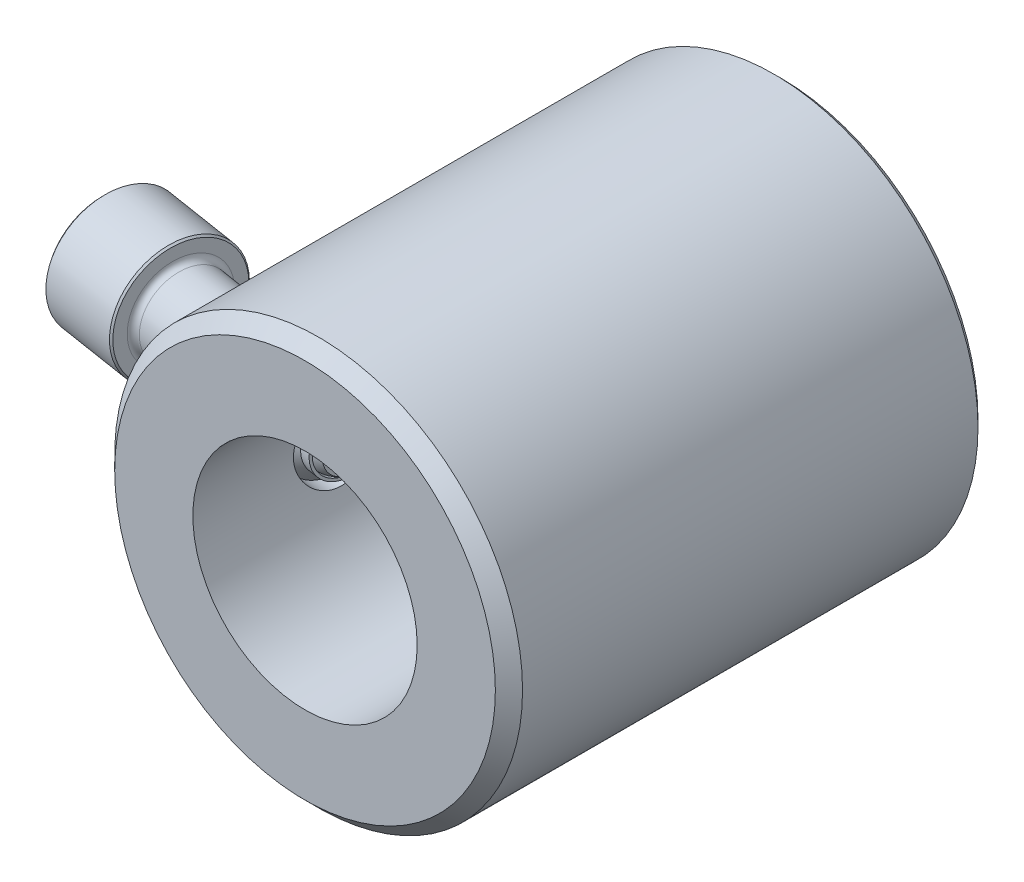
ISO-10303-21;
HEADER;
FILE_DESCRIPTION(('STEP AP214'),'2;1');
FILE_NAME('part.step','',(''),(''),'','','');
FILE_SCHEMA(('AUTOMOTIVE_DESIGN { 1 0 10303 214 1 1 1 1 }'));
ENDSEC;
DATA;
#1=APPLICATION_CONTEXT('core data for automotive mechanical design processes');
#2=APPLICATION_PROTOCOL_DEFINITION('international standard','automotive_design',2000,#1);
#3=PRODUCT_CONTEXT('',#1,'mechanical');
#4=PRODUCT('Part','Part','',(#3));
#5=PRODUCT_RELATED_PRODUCT_CATEGORY('part','',(#4));
#6=PRODUCT_DEFINITION_FORMATION('','',#4);
#7=PRODUCT_DEFINITION_CONTEXT('part definition',#1,'design');
#8=PRODUCT_DEFINITION('design','',#6,#7);
#9=PRODUCT_DEFINITION_SHAPE('','',#8);
#10=(LENGTH_UNIT() NAMED_UNIT(*) SI_UNIT(.MILLI.,.METRE.));
#11=(NAMED_UNIT(*) PLANE_ANGLE_UNIT() SI_UNIT($,.RADIAN.));
#12=(NAMED_UNIT(*) SI_UNIT($,.STERADIAN.) SOLID_ANGLE_UNIT());
#13=UNCERTAINTY_MEASURE_WITH_UNIT(LENGTH_MEASURE(1.E-05),#10,'distance_accuracy_value','');
#14=(GEOMETRIC_REPRESENTATION_CONTEXT(3) GLOBAL_UNCERTAINTY_ASSIGNED_CONTEXT((#13)) GLOBAL_UNIT_ASSIGNED_CONTEXT((#10,
#11,#12)) REPRESENTATION_CONTEXT('',''));
#15=CARTESIAN_POINT('',(0.,0.,0.));
#16=DIRECTION('',(0.,0.,1.));
#17=DIRECTION('',(1.,0.,0.));
#18=AXIS2_PLACEMENT_3D('',#15,#16,#17);
#19=CARTESIAN_POINT('',(0.,-6.97458720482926,45.));
#20=DIRECTION('',(0.,1.,0.));
#21=DIRECTION('',(0.,0.,1.));
#22=AXIS2_PLACEMENT_3D('',#19,#20,#21);
#23=CYLINDRICAL_SURFACE('',#22,2.5);
#24=CARTESIAN_POINT('',(0.,-27.5,45.));
#25=DIRECTION('',(0.,-1.,0.));
#26=DIRECTION('',(0.,0.,-1.));
#27=AXIS2_PLACEMENT_3D('',#24,#25,#26);
#28=CIRCLE('',#27,2.5);
#29=CARTESIAN_POINT('',(0.,-27.5,42.5));
#30=VERTEX_POINT('',#29);
#31=EDGE_CURVE('E10',#30,#30,#28,.T.);
#32=ORIENTED_EDGE('',*,*,#31,.F.);
#33=EDGE_LOOP('',(#32));
#34=FACE_BOUND('',#33,.T.);
#35=CARTESIAN_POINT('',(0.,-30.,47.5));
#36=CARTESIAN_POINT('',(-0.140165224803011,-29.9999986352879,47.4999938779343));
#37=CARTESIAN_POINT('',(-0.280425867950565,-29.9990072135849,47.4881725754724));
#38=CARTESIAN_POINT('',(-0.557066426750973,-29.9951475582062,47.4411891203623));
#39=CARTESIAN_POINT('',(-0.693441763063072,-29.9922771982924,47.4060005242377));
#40=CARTESIAN_POINT('',(-0.958265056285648,-29.9849840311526,47.3133071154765));
#41=CARTESIAN_POINT('',(-1.08671745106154,-29.9805621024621,47.2558149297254));
#42=CARTESIAN_POINT('',(-1.33211808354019,-29.9706616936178,47.12016892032));
#43=CARTESIAN_POINT('',(-1.44906877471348,-29.9651834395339,47.0420195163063));
#44=CARTESIAN_POINT('',(-1.66847499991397,-29.9537694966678,46.867062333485));
#45=CARTESIAN_POINT('',(-1.77089718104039,-29.9478328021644,46.7702127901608));
#46=CARTESIAN_POINT('',(-1.95805283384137,-29.9361795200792,46.5606927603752));
#47=CARTESIAN_POINT('',(-2.04278552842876,-29.930462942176,46.4480215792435));
#48=CARTESIAN_POINT('',(-2.19226980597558,-29.9198863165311,46.2098547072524));
#49=CARTESIAN_POINT('',(-2.25699208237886,-29.9150275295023,46.0843405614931));
#50=CARTESIAN_POINT('',(-2.36443108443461,-29.9067281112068,45.82417926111));
#51=CARTESIAN_POINT('',(-2.40714819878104,-29.9032874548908,45.6895322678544));
#52=CARTESIAN_POINT('',(-2.46926757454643,-29.898222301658,45.415261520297));
#53=CARTESIAN_POINT('',(-2.48872416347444,-29.8965935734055,45.2756501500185));
#54=CARTESIAN_POINT('',(-2.50393802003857,-29.8953233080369,44.9951344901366));
#55=CARTESIAN_POINT('',(-2.49969573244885,-29.8956817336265,44.8542302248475));
#56=CARTESIAN_POINT('',(-2.46767716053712,-29.8983414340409,44.5755008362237));
#57=CARTESIAN_POINT('',(-2.43995992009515,-29.9006378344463,44.437668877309));
#58=CARTESIAN_POINT('',(-2.36186996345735,-29.9069070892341,44.1686203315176));
#59=CARTESIAN_POINT('',(-2.31149702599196,-29.91087995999,44.0374038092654));
#60=CARTESIAN_POINT('',(-2.18945947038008,-29.9200601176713,43.7851227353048));
#61=CARTESIAN_POINT('',(-2.11776836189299,-29.9252689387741,43.6640710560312));
#62=CARTESIAN_POINT('',(-1.95514860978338,-29.936332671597,43.4356966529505));
#63=CARTESIAN_POINT('',(-1.86421957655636,-29.9421875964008,43.3283742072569));
#64=CARTESIAN_POINT('',(-1.66537395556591,-29.9539055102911,43.1301614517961));
#65=CARTESIAN_POINT('',(-1.55740632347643,-29.9597684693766,43.0393223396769));
#66=CARTESIAN_POINT('',(-1.32772639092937,-29.9708247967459,42.8770506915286));
#67=CARTESIAN_POINT('',(-1.20601408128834,-29.9760181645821,42.8056181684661));
#68=CARTESIAN_POINT('',(-0.952266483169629,-29.985151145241,42.6841905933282));
#69=CARTESIAN_POINT('',(-0.820230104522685,-29.9890906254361,42.6341978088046));
#70=CARTESIAN_POINT('',(-0.549597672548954,-29.9952704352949,42.5571046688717));
#71=CARTESIAN_POINT('',(-0.411001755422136,-29.9975108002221,42.5300038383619));
#72=CARTESIAN_POINT('',(-0.131628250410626,-30.0000354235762,42.4995280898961));
#73=CARTESIAN_POINT('',(0.00914157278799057,-30.0003255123,42.4960824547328));
#74=CARTESIAN_POINT('',(0.289256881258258,-29.9989324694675,42.5128296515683));
#75=CARTESIAN_POINT('',(0.428602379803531,-29.9972493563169,42.5330222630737));
#76=CARTESIAN_POINT('',(0.701711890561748,-29.992102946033,42.5964141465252));
#77=CARTESIAN_POINT('',(0.835483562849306,-29.9886421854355,42.6395806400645));
#78=CARTESIAN_POINT('',(1.09388541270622,-29.9803292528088,42.7476614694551));
#79=CARTESIAN_POINT('',(1.21851544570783,-29.975477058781,42.8125761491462));
#80=CARTESIAN_POINT('',(1.45541804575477,-29.9649106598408,42.9624883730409));
#81=CARTESIAN_POINT('',(1.56766087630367,-29.9591944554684,43.0475327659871));
#82=CARTESIAN_POINT('',(1.77630273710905,-29.9475489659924,43.2352226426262));
#83=CARTESIAN_POINT('',(1.87270149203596,-29.9416196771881,43.3378684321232));
#84=CARTESIAN_POINT('',(2.04716136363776,-29.9301990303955,43.5581542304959));
#85=CARTESIAN_POINT('',(2.12517633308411,-29.9247087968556,43.6758308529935));
#86=CARTESIAN_POINT('',(2.2603376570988,-29.914803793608,43.9226556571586));
#87=CARTESIAN_POINT('',(2.31748422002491,-29.9103890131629,44.0518037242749));
#88=CARTESIAN_POINT('',(2.40920794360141,-29.9031410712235,44.3177419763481));
#89=CARTESIAN_POINT('',(2.44381335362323,-29.9003059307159,44.4545223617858));
#90=CARTESIAN_POINT('',(2.48956442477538,-29.8965316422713,44.7319767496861));
#91=CARTESIAN_POINT('',(2.50071053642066,-29.8955924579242,44.872650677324));
#92=CARTESIAN_POINT('',(2.49922140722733,-29.8957169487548,45.1534403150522));
#93=CARTESIAN_POINT('',(2.48665867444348,-29.8967745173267,45.2935564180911));
#94=CARTESIAN_POINT('',(2.43825965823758,-29.9007603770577,45.5696813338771));
#95=CARTESIAN_POINT('',(2.40242333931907,-29.9036886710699,45.7056901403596));
#96=CARTESIAN_POINT('',(2.30851277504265,-29.9110844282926,45.9697444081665));
#97=CARTESIAN_POINT('',(2.25043983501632,-29.9155518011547,46.0977903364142));
#98=CARTESIAN_POINT('',(2.11371264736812,-29.9255224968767,46.3423271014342));
#99=CARTESIAN_POINT('',(2.03505872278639,-29.9310258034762,46.4588181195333));
#100=CARTESIAN_POINT('',(1.85912985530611,-29.942468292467,46.6773093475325));
#101=CARTESIAN_POINT('',(1.76180123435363,-29.9484087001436,46.7792662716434));
#102=CARTESIAN_POINT('',(1.55138306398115,-29.960044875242,46.9654379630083));
#103=CARTESIAN_POINT('',(1.43828970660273,-29.9657405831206,47.0496484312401));
#104=CARTESIAN_POINT('',(1.19933443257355,-29.9762558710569,47.1980496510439));
#105=CARTESIAN_POINT('',(1.07344914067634,-29.9810738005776,47.2622028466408));
#106=CARTESIAN_POINT('',(0.812739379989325,-29.9892713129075,47.3683795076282));
#107=CARTESIAN_POINT('',(0.677925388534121,-29.9926525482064,47.4104284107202));
#108=CARTESIAN_POINT('',(0.451930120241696,-29.9967276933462,47.4604939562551));
#109=CARTESIAN_POINT('',(0.362202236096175,-29.9979492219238,47.4752890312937));
#110=CARTESIAN_POINT('',(0.181662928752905,-29.9995858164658,47.495044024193));
#111=CARTESIAN_POINT('',(0.0908515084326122,-30.0000008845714,47.5000039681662));
#112=CARTESIAN_POINT('',(0.,-30.,47.5));
#113=B_SPLINE_CURVE_WITH_KNOTS('',3,(#35,#36,#37,#38,#39,#40,#41,#42,#43,#44,#45,#46,#47,#48,
#49,#50,#51,#52,#53,#54,#55,#56,#57,#58,#59,#60,#61,#62,#63,#64,#65,#66,#67,#68,#69,#70,#71,#72,
#73,#74,#75,#76,#77,#78,#79,#80,#81,#82,#83,#84,#85,#86,#87,#88,#89,#90,#91,#92,#93,#94,#95,#96,
#97,#98,#99,#100,#101,#102,#103,#104,#105,#106,#107,#108,#109,#110,#111,#112),.UNSPECIFIED.,.T.,
.F.,(4,2,2,2,2,2,2,2,2,2,2,2,2,2,2,2,2,2,2,2,2,2,2,2,2,2,2,2,2,2,2,2,2,2,2,2,2,2,4),(0.,
0.420163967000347,0.840804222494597,1.26120668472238,1.68151927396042,2.10278167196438,
2.52406257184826,2.94595757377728,3.36784512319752,3.78874537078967,4.20963771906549,
4.62947457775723,5.04931553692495,5.46968039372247,5.89005376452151,6.31171127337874,
6.73336906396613,7.15507143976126,7.57676506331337,7.99719748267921,8.41762598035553,
8.83745622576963,9.25729310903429,9.67811687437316,10.0989479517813,10.5208244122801,
10.9426966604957,11.3640391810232,11.7853736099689,12.2054215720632,12.6254701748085,
13.0454941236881,13.4655114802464,13.886754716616,14.308099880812,14.7302293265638,
15.1518719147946,15.4242121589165,15.6965516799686),.UNSPECIFIED.);
#114=CARTESIAN_POINT('',(0.,-30.,47.5));
#115=VERTEX_POINT('',#114);
#116=EDGE_CURVE('E345',#115,#115,#113,.T.);
#117=ORIENTED_EDGE('',*,*,#116,.T.);
#118=EDGE_LOOP('',(#117));
#119=FACE_BOUND('',#118,.T.);
#120=ADVANCED_FACE('F15',(#34,#119),#23,.F.);
#121=CARTESIAN_POINT('',(-11.8292635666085,0.,49.8779619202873));
#122=DIRECTION('',(0.987688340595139,0.,0.156434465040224));
#123=DIRECTION('',(0.156434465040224,0.,-0.987688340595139));
#124=AXIS2_PLACEMENT_3D('',#121,#122,#123);
#125=CYLINDRICAL_SURFACE('',#124,6.);
#126=CARTESIAN_POINT('',(-16.5,0.,43.0633991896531));
#127=CARTESIAN_POINT('',(-16.5000003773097,-0.156454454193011,43.0633985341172));
#128=CARTESIAN_POINT('',(-16.4977695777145,-0.312901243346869,43.0699544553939));
#129=CARTESIAN_POINT('',(-16.4889100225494,-0.624632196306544,43.0960906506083));
#130=CARTESIAN_POINT('',(-16.4822797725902,-0.779915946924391,43.1156753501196));
#131=CARTESIAN_POINT('',(-16.4648105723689,-1.08803421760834,43.1676028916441));
#132=CARTESIAN_POINT('',(-16.453973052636,-1.240869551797,43.1999413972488));
#133=CARTESIAN_POINT('',(-16.4283844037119,-1.5431146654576,43.2769777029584));
#134=CARTESIAN_POINT('',(-16.4136316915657,-1.69252303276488,43.3216805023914));
#135=CARTESIAN_POINT('',(-16.3806667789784,-1.98633387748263,43.4227285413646));
#136=CARTESIAN_POINT('',(-16.3624674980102,-2.1307527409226,43.4790303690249));
#137=CARTESIAN_POINT('',(-16.3230371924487,-2.41433066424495,43.6027694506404));
#138=CARTESIAN_POINT('',(-16.3018050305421,-2.55348772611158,43.6702108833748));
#139=CARTESIAN_POINT('',(-16.2343252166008,-2.96185830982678,43.8882617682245));
#140=CARTESIAN_POINT('',(-16.1842686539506,-3.22218868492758,44.0546736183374));
#141=CARTESIAN_POINT('',(-16.0753190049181,-3.72901739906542,44.4353751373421));
#142=CARTESIAN_POINT('',(-16.0160723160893,-3.97368924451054,44.6519746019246));
#143=CARTESIAN_POINT('',(-15.8968650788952,-4.42657425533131,45.1203039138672));
#144=CARTESIAN_POINT('',(-15.8369041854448,-4.63476896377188,45.3720514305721));
#145=CARTESIAN_POINT('',(-15.7163077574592,-5.02935018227,45.9310343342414));
#146=CARTESIAN_POINT('',(-15.6561691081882,-5.21167287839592,46.2412822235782));
#147=CARTESIAN_POINT('',(-15.5758344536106,-5.44519300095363,46.7271484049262));
#148=CARTESIAN_POINT('',(-15.5506891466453,-5.51640442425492,46.8926295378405));
#149=CARTESIAN_POINT('',(-15.5045060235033,-5.64490611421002,47.2294415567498));
#150=CARTESIAN_POINT('',(-15.4834663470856,-5.70220268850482,47.4007697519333));
#151=CARTESIAN_POINT('',(-15.4462489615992,-5.80226213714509,47.7481573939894));
#152=CARTESIAN_POINT('',(-15.430071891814,-5.84502310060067,47.9242174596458));
#153=CARTESIAN_POINT('',(-15.4032307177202,-5.91539569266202,48.2796864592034));
#154=CARTESIAN_POINT('',(-15.392564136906,-5.94301412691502,48.4590938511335));
#155=CARTESIAN_POINT('',(-15.3772222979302,-5.98259876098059,48.8198123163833));
#156=CARTESIAN_POINT('',(-15.3725444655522,-5.99457168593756,49.0011225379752));
#157=CARTESIAN_POINT('',(-15.369453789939,-6.00249225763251,49.3641441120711));
#158=CARTESIAN_POINT('',(-15.3710403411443,-5.99844145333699,49.5458554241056));
#159=CARTESIAN_POINT('',(-15.3801074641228,-5.97515081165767,49.892445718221));
#160=CARTESIAN_POINT('',(-15.3870697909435,-5.95724622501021,50.0574292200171));
#161=CARTESIAN_POINT('',(-15.4060979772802,-5.90786307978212,50.3850512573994));
#162=CARTESIAN_POINT('',(-15.4181635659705,-5.87638524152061,50.5476899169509));
#163=CARTESIAN_POINT('',(-15.4470583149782,-5.80000453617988,50.8693269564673));
#164=CARTESIAN_POINT('',(-15.463886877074,-5.75510335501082,51.0283257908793));
#165=CARTESIAN_POINT('',(-15.5018062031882,-5.65216853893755,51.3414885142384));
#166=CARTESIAN_POINT('',(-15.5228969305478,-5.59413501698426,51.4956524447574));
#167=CARTESIAN_POINT('',(-15.5676827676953,-5.4682274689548,51.7912967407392));
#168=CARTESIAN_POINT('',(-15.591220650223,-5.40090481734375,51.9330363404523));
#169=CARTESIAN_POINT('',(-15.6409658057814,-5.25510424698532,52.2102254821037));
#170=CARTESIAN_POINT('',(-15.6671739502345,-5.17662268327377,52.3456729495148));
#171=CARTESIAN_POINT('',(-15.7215409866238,-5.00908174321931,52.6093942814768));
#172=CARTESIAN_POINT('',(-15.7496994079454,-4.92002491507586,52.7376698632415));
#173=CARTESIAN_POINT('',(-15.8072454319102,-4.73187812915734,52.986418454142));
#174=CARTESIAN_POINT('',(-15.8366334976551,-4.63278437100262,53.1068884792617));
#175=CARTESIAN_POINT('',(-15.8968785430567,-4.42172978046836,53.3432576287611));
#176=CARTESIAN_POINT('',(-15.9277516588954,-4.30944798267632,53.4588661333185));
#177=CARTESIAN_POINT('',(-15.9891933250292,-4.07557574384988,53.6804262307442));
#178=CARTESIAN_POINT('',(-16.0197617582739,-3.95398187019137,53.786374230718));
#179=CARTESIAN_POINT('',(-16.0797850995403,-3.70232869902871,53.9879824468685));
#180=CARTESIAN_POINT('',(-16.1092402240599,-3.5722710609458,54.0836446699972));
#181=CARTESIAN_POINT('',(-16.1663042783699,-3.30444523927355,54.2642253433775));
#182=CARTESIAN_POINT('',(-16.1939125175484,-3.1666742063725,54.3491397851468));
#183=CARTESIAN_POINT('',(-16.247461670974,-2.87958610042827,54.5103847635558));
#184=CARTESIAN_POINT('',(-16.2733153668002,-2.73003660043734,54.5863309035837));
#185=CARTESIAN_POINT('',(-16.3216125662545,-2.42463827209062,54.7257655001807));
#186=CARTESIAN_POINT('',(-16.3440547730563,-2.26878707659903,54.7892492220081));
#187=CARTESIAN_POINT('',(-16.3849087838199,-1.95198826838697,54.9032941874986));
#188=CARTESIAN_POINT('',(-16.4033223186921,-1.79104287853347,54.9538609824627));
#189=CARTESIAN_POINT('',(-16.4356437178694,-1.46507592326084,55.0417855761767));
#190=CARTESIAN_POINT('',(-16.4495499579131,-1.30005291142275,55.079138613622));
#191=CARTESIAN_POINT('',(-16.4723665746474,-0.968738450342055,55.140065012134));
#192=CARTESIAN_POINT('',(-16.4813222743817,-0.802473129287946,55.1637634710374));
#193=CARTESIAN_POINT('',(-16.4941978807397,-0.468381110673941,55.1977495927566));
#194=CARTESIAN_POINT('',(-16.4981177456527,-0.300554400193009,55.2080371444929));
#195=CARTESIAN_POINT('',(-16.5008170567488,0.0354093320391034,55.2151268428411));
#196=CARTESIAN_POINT('',(-16.4995969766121,0.203546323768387,55.2119302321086));
#197=CARTESIAN_POINT('',(-16.4920498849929,0.538907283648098,55.1920773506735));
#198=CARTESIAN_POINT('',(-16.4857229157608,0.70613125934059,55.1754211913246));
#199=CARTESIAN_POINT('',(-16.4682735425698,1.03574262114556,55.1291476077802));
#200=CARTESIAN_POINT('',(-16.457230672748,1.19816445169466,55.0997450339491));
#201=CARTESIAN_POINT('',(-16.4306490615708,1.51980658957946,55.0282278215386));
#202=CARTESIAN_POINT('',(-16.4151103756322,1.67902693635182,54.9861133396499));
#203=CARTESIAN_POINT('',(-16.379929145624,1.99321799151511,54.8894338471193));
#204=CARTESIAN_POINT('',(-16.3602855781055,2.14818762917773,54.8348657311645));
#205=CARTESIAN_POINT('',(-16.3174039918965,2.45274753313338,54.7136458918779));
#206=CARTESIAN_POINT('',(-16.2941671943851,2.60233960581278,54.646998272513));
#207=CARTESIAN_POINT('',(-16.2443832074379,2.89700044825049,54.5011223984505));
#208=CARTESIAN_POINT('',(-16.2177992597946,3.04199227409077,54.4217512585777));
#209=CARTESIAN_POINT('',(-16.1622505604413,3.32451176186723,54.2515169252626));
#210=CARTESIAN_POINT('',(-16.1332866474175,3.46204202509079,54.1606577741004));
#211=CARTESIAN_POINT('',(-16.07371410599,3.72886212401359,53.9678861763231));
#212=CARTESIAN_POINT('',(-16.043104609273,3.85814752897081,53.8659678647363));
#213=CARTESIAN_POINT('',(-15.9810824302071,4.1074939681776,53.6517233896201));
#214=CARTESIAN_POINT('',(-15.9496700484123,4.2275583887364,53.5394010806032));
#215=CARTESIAN_POINT('',(-15.8863846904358,4.4595367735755,53.3030724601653));
#216=CARTESIAN_POINT('',(-15.8545123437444,4.57129053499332,53.1789085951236));
#217=CARTESIAN_POINT('',(-15.7917392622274,4.78364181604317,52.9212340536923));
#218=CARTESIAN_POINT('',(-15.7608381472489,4.8842437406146,52.7877271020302));
#219=CARTESIAN_POINT('',(-15.7009046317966,5.07360449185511,52.5121213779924));
#220=CARTESIAN_POINT('',(-15.6718726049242,5.16236095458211,52.3700208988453));
#221=CARTESIAN_POINT('',(-15.6165835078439,5.32727746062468,52.0782528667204));
#222=CARTESIAN_POINT('',(-15.5903252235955,5.40344302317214,51.9285886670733));
#223=CARTESIAN_POINT('',(-15.5420252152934,5.54081390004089,51.6266607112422));
#224=CARTESIAN_POINT('',(-15.5198919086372,5.60235554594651,51.4745646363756));
#225=CARTESIAN_POINT('',(-15.4796984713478,5.7124752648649,51.1652941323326));
#226=CARTESIAN_POINT('',(-15.4616366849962,5.76105860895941,51.0081217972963));
#227=CARTESIAN_POINT('',(-15.4301159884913,5.84495779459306,50.6898389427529));
#228=CARTESIAN_POINT('',(-15.4166566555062,5.88027485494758,50.5287287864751));
#229=CARTESIAN_POINT('',(-15.3947234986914,5.9374598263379,50.2038079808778));
#230=CARTESIAN_POINT('',(-15.3862495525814,5.95932806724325,50.0399973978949));
#231=CARTESIAN_POINT('',(-15.3747319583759,5.98897796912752,49.7175437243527));
#232=CARTESIAN_POINT('',(-15.3714846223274,5.99728819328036,49.5589560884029));
#233=CARTESIAN_POINT('',(-15.3698068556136,6.00158668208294,49.2415384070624));
#234=CARTESIAN_POINT('',(-15.3713780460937,5.99757079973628,49.0827082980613));
#235=CARTESIAN_POINT('',(-15.3792244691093,5.97742168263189,48.7659798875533));
#236=CARTESIAN_POINT('',(-15.38549857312,5.9612913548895,48.6080813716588));
#237=CARTESIAN_POINT('',(-15.4025049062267,5.91721199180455,48.2941340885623));
#238=CARTESIAN_POINT('',(-15.4132388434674,5.88925842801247,48.1380860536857));
#239=CARTESIAN_POINT('',(-15.4391595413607,5.82097278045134,47.8246030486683));
#240=CARTESIAN_POINT('',(-15.454459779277,5.7803238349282,47.6672463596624));
#241=CARTESIAN_POINT('',(-15.4889065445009,5.68737342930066,47.3564247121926));
#242=CARTESIAN_POINT('',(-15.5080544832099,5.63506769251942,47.202961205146));
#243=CARTESIAN_POINT('',(-15.5704587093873,5.46132336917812,46.7497089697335));
#244=CARTESIAN_POINT('',(-15.6186910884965,5.32301846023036,46.4568809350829));
#245=CARTESIAN_POINT('',(-15.7279574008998,4.99142923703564,45.8719778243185));
#246=CARTESIAN_POINT('',(-15.7897389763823,4.79441570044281,45.5821727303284));
#247=CARTESIAN_POINT('',(-15.9163178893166,4.35577325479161,45.0387370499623));
#248=CARTESIAN_POINT('',(-15.9811166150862,4.11412365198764,44.7851233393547));
#249=CARTESIAN_POINT('',(-16.0764933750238,3.71697967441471,44.4331786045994));
#250=CARTESIAN_POINT('',(-16.1085658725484,3.57581645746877,44.3187502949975));
#251=CARTESIAN_POINT('',(-16.1706693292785,3.28355485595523,44.1027829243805));
#252=CARTESIAN_POINT('',(-16.2007011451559,3.13246069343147,44.0012384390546));
#253=CARTESIAN_POINT('',(-16.2577808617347,2.8212730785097,43.8121571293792));
#254=CARTESIAN_POINT('',(-16.2848296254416,2.66118224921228,43.7246162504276));
#255=CARTESIAN_POINT('',(-16.3350661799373,2.33305419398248,43.5646028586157));
#256=CARTESIAN_POINT('',(-16.3582543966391,2.16501784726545,43.4921286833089));
#257=CARTESIAN_POINT('',(-16.3983852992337,1.83532294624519,43.3681739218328));
#258=CARTESIAN_POINT('',(-16.4156683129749,1.67414746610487,43.3155178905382));
#259=CARTESIAN_POINT('',(-16.445714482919,1.34736221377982,43.2246796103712));
#260=CARTESIAN_POINT('',(-16.4584781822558,1.18175297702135,43.1864956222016));
#261=CARTESIAN_POINT('',(-16.4790668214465,0.847564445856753,43.1251824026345));
#262=CARTESIAN_POINT('',(-16.4868946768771,0.678986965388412,43.1020442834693));
#263=CARTESIAN_POINT('',(-16.4973608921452,0.340269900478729,43.0711535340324));
#264=CARTESIAN_POINT('',(-16.499999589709,0.170130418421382,43.0633999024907));
#265=CARTESIAN_POINT('',(-16.5,0.,43.0633991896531));
#266=B_SPLINE_CURVE_WITH_KNOTS('',3,(#126,#127,#128,#129,#130,#131,#132,#133,#134,#135,#136,
#137,#138,#139,#140,#141,#142,#143,#144,#145,#146,#147,#148,#149,#150,#151,#152,#153,#154,#155,
#156,#157,#158,#159,#160,#161,#162,#163,#164,#165,#166,#167,#168,#169,#170,#171,#172,#173,#174,
#175,#176,#177,#178,#179,#180,#181,#182,#183,#184,#185,#186,#187,#188,#189,#190,#191,#192,#193,
#194,#195,#196,#197,#198,#199,#200,#201,#202,#203,#204,#205,#206,#207,#208,#209,#210,#211,#212,
#213,#214,#215,#216,#217,#218,#219,#220,#221,#222,#223,#224,#225,#226,#227,#228,#229,#230,#231,
#232,#233,#234,#235,#236,#237,#238,#239,#240,#241,#242,#243,#244,#245,#246,#247,#248,#249,#250,
#251,#252,#253,#254,#255,#256,#257,#258,#259,#260,#261,#262,#263,#264,#265),.UNSPECIFIED.,.T.,
.F.,(4,2,2,2,2,2,2,2,2,2,2,2,2,2,2,2,2,2,2,2,2,2,2,2,2,2,2,2,2,2,2,2,2,2,2,2,2,2,2,2,2,2,2,2,2,
2,2,2,2,2,2,2,2,2,2,2,2,2,2,2,2,2,2,2,2,2,2,2,2,4),(0.,0.469197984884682,0.938555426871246,
1.40775342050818,1.87714140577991,2.34480352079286,2.81264146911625,3.74763022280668,
4.73994091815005,5.73275226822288,6.8216988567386,7.36685506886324,7.91176369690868,
8.45674393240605,9.00147903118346,9.54597990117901,10.0904281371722,10.5880869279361,
11.0857193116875,11.5832892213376,12.0808548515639,12.5563268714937,13.0319545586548,
13.5074678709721,13.9831619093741,14.4748779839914,14.966776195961,15.4585782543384,
15.9505631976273,16.459082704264,16.9677950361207,17.4762883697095,17.9849647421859,
18.4889035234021,18.992846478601,19.4967429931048,20.0006353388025,20.4963457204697,
20.9920499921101,21.4878780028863,21.98353787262,22.4852140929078,22.9867142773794,
23.4884817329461,23.9900640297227,24.4996322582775,25.0089984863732,25.518466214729,
26.027710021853,26.5237665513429,27.0196209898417,27.5154298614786,28.0112265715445,
28.4871878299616,28.9633092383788,29.4393164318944,29.9155061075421,30.4046853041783,
30.8940442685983,31.8722204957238,32.9352718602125,33.9988173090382,34.5517909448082,
35.1045309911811,35.6571107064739,36.2096294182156,36.7202372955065,37.2307837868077,
37.7410284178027,38.2512398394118),.UNSPECIFIED.);
#267=CARTESIAN_POINT('',(-16.5,0.,43.0633991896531));
#268=VERTEX_POINT('',#267);
#269=EDGE_CURVE('E291',#268,#268,#266,.T.);
#270=ORIENTED_EDGE('',*,*,#269,.F.);
#271=EDGE_LOOP('',(#270));
#272=FACE_BOUND('',#271,.T.);
#273=CARTESIAN_POINT('',(-17.4612507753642,0.,48.9859427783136));
#274=DIRECTION('',(0.987688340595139,0.,0.156434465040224));
#275=DIRECTION('',(0.156434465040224,0.,-0.987688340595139));
#276=AXIS2_PLACEMENT_3D('',#273,#274,#275);
#277=CIRCLE('',#276,6.);
#278=CARTESIAN_POINT('',(-16.5226439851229,0.,43.0598127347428));
#279=VERTEX_POINT('',#278);
#280=EDGE_CURVE('E255',#279,#279,#277,.T.);
#281=ORIENTED_EDGE('',*,*,#280,.F.);
#282=EDGE_LOOP('',(#281));
#283=FACE_BOUND('',#282,.T.);
#284=ADVANCED_FACE('F310',(#272,#283),#125,.F.);
#285=CARTESIAN_POINT('',(0.,0.,70.));
#286=DIRECTION('',(0.,0.,-1.));
#287=DIRECTION('',(-1.,0.,0.));
#288=AXIS2_PLACEMENT_3D('',#285,#286,#287);
#289=CYLINDRICAL_SURFACE('',#288,30.);
#290=CARTESIAN_POINT('',(0.,0.,0.999999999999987));
#291=DIRECTION('',(0.,0.,1.));
#292=DIRECTION('',(1.,0.,0.));
#293=AXIS2_PLACEMENT_3D('',#290,#291,#292);
#294=CIRCLE('',#293,30.);
#295=CARTESIAN_POINT('',(30.,0.,0.999999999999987));
#296=VERTEX_POINT('',#295);
#297=EDGE_CURVE('E375',#296,#296,#294,.T.);
#298=ORIENTED_EDGE('',*,*,#297,.T.);
#299=EDGE_LOOP('',(#298));
#300=FACE_BOUND('',#299,.T.);
#301=CARTESIAN_POINT('',(0.,0.,68.));
#302=DIRECTION('',(0.,0.,1.));
#303=DIRECTION('',(1.,0.,0.));
#304=AXIS2_PLACEMENT_3D('',#301,#302,#303);
#305=CIRCLE('',#304,30.);
#306=CARTESIAN_POINT('',(30.,0.,68.));
#307=VERTEX_POINT('',#306);
#308=EDGE_CURVE('E371',#307,#307,#305,.F.);
#309=ORIENTED_EDGE('',*,*,#308,.T.);
#310=EDGE_LOOP('',(#309));
#311=FACE_BOUND('',#310,.T.);
#312=ORIENTED_EDGE('',*,*,#116,.F.);
#313=EDGE_LOOP('',(#312));
#314=FACE_BOUND('',#313,.T.);
#315=CARTESIAN_POINT('',(-30.,0.,53.074790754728));
#316=CARTESIAN_POINT('',(-30.0000016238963,0.168595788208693,53.0747935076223));
#317=CARTESIAN_POINT('',(-29.9985763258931,0.337151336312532,53.0678200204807));
#318=CARTESIAN_POINT('',(-29.9929177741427,0.673113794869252,53.0399755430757));
#319=CARTESIAN_POINT('',(-29.9886840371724,0.840520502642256,53.0191021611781));
#320=CARTESIAN_POINT('',(-29.9775199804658,1.17302754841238,52.9635728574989));
#321=CARTESIAN_POINT('',(-29.9705882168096,1.33812660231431,52.928909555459));
#322=CARTESIAN_POINT('',(-29.9542172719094,1.66481980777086,52.8460111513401));
#323=CARTESIAN_POINT('',(-29.9447771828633,1.82641266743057,52.7977711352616));
#324=CARTESIAN_POINT('',(-29.9236596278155,2.14476774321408,52.6880762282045));
#325=CARTESIAN_POINT('',(-29.9119837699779,2.30153333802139,52.6266308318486));
#326=CARTESIAN_POINT('',(-29.8867093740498,2.60930144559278,52.4908770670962));
#327=CARTESIAN_POINT('',(-29.8731101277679,2.76030180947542,52.4165639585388));
#328=CARTESIAN_POINT('',(-29.8443781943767,3.0553313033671,52.2556132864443));
#329=CARTESIAN_POINT('',(-29.8292462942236,3.19936395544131,52.1689820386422));
#330=CARTESIAN_POINT('',(-29.7978603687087,3.47956941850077,51.9838961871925));
#331=CARTESIAN_POINT('',(-29.7816059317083,3.61573931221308,51.8854372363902));
#332=CARTESIAN_POINT('',(-29.7484430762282,3.87914328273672,51.6774056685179));
#333=CARTESIAN_POINT('',(-29.7315348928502,4.00638052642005,51.5678370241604));
#334=CARTESIAN_POINT('',(-29.6975312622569,4.25110673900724,51.3382433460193));
#335=CARTESIAN_POINT('',(-29.6804357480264,4.36859208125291,51.2182144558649));
#336=CARTESIAN_POINT('',(-29.6465578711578,4.59287142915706,50.9685977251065));
#337=CARTESIAN_POINT('',(-29.6297753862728,4.69966968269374,50.8390137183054));
#338=CARTESIAN_POINT('',(-29.5969916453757,4.9018961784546,50.571088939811));
#339=CARTESIAN_POINT('',(-29.5809906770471,4.99732025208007,50.4327449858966));
#340=CARTESIAN_POINT('',(-29.5503484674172,5.17542428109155,50.14934055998));
#341=CARTESIAN_POINT('',(-29.5356982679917,5.25819102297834,50.0043355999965));
#342=CARTESIAN_POINT('',(-29.5080400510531,5.41124969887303,49.7076693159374));
#343=CARTESIAN_POINT('',(-29.4950326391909,5.48153703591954,49.5560055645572));
#344=CARTESIAN_POINT('',(-29.4710410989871,5.60909630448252,49.2472130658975));
#345=CARTESIAN_POINT('',(-29.4600560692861,5.66637403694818,49.090086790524));
#346=CARTESIAN_POINT('',(-29.4404025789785,5.76760912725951,48.771442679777));
#347=CARTESIAN_POINT('',(-29.4317349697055,5.81156159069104,48.6099232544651));
#348=CARTESIAN_POINT('',(-29.4097090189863,5.92241382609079,48.1229771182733));
#349=CARTESIAN_POINT('',(-29.4001214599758,5.96936735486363,47.7925830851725));
#350=CARTESIAN_POINT('',(-29.3920530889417,6.0089552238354,47.1286679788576));
#351=CARTESIAN_POINT('',(-29.3935729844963,6.0015861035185,46.7951467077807));
#352=CARTESIAN_POINT('',(-29.4074656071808,5.93314731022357,46.1293097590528));
#353=CARTESIAN_POINT('',(-29.4199798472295,5.87137739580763,45.7970667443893));
#354=CARTESIAN_POINT('',(-29.4458438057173,5.73969875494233,45.3099714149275));
#355=CARTESIAN_POINT('',(-29.4556550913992,5.68926071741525,45.1493933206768));
#356=CARTESIAN_POINT('',(-29.477352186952,5.57575828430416,44.8329210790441));
#357=CARTESIAN_POINT('',(-29.4892373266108,5.51269796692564,44.6770254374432));
#358=CARTESIAN_POINT('',(-29.5151831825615,5.37207879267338,44.3657890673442));
#359=CARTESIAN_POINT('',(-29.5293032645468,5.29410632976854,44.2106404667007));
#360=CARTESIAN_POINT('',(-29.5589988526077,5.12570906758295,43.9074686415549));
#361=CARTESIAN_POINT('',(-29.5745738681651,5.03528846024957,43.7594430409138));
#362=CARTESIAN_POINT('',(-29.6067511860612,4.84250303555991,43.471386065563));
#363=CARTESIAN_POINT('',(-29.6233540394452,4.7401317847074,43.3313590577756));
#364=CARTESIAN_POINT('',(-29.657106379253,4.52415515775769,43.0604099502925));
#365=CARTESIAN_POINT('',(-29.6742556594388,4.41055398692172,42.9294844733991));
#366=CARTESIAN_POINT('',(-29.7089347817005,4.17062877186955,42.6753633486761));
#367=CARTESIAN_POINT('',(-29.7264659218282,4.04411267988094,42.5523490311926));
#368=CARTESIAN_POINT('',(-29.7610811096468,3.78095908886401,42.3177056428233));
#369=CARTESIAN_POINT('',(-29.7781653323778,3.64432563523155,42.206072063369));
#370=CARTESIAN_POINT('',(-29.8113907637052,3.36172919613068,41.9950520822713));
#371=CARTESIAN_POINT('',(-29.827531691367,3.21576345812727,41.8956693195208));
#372=CARTESIAN_POINT('',(-29.8583674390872,2.91558590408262,41.7101418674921));
#373=CARTESIAN_POINT('',(-29.8730629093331,2.76137784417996,41.6239912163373));
#374=CARTESIAN_POINT('',(-29.9001540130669,2.45039349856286,41.4680523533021));
#375=CARTESIAN_POINT('',(-29.9126045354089,2.29382581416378,41.3978577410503));
#376=CARTESIAN_POINT('',(-29.935340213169,1.97507444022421,41.2714170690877));
#377=CARTESIAN_POINT('',(-29.9456263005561,1.81289320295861,41.2151650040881));
#378=CARTESIAN_POINT('',(-29.9637212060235,1.48408744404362,41.1171739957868));
#379=CARTESIAN_POINT('',(-29.971530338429,1.31746348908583,41.0754332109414));
#380=CARTESIAN_POINT('',(-29.9844266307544,0.981062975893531,41.0069220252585));
#381=CARTESIAN_POINT('',(-29.9895139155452,0.811286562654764,40.9801509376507));
#382=CARTESIAN_POINT('',(-29.9966064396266,0.479236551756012,40.9429252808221));
#383=CARTESIAN_POINT('',(-29.9987640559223,0.31705622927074,40.9316635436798));
#384=CARTESIAN_POINT('',(-30.0004386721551,-0.0077473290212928,40.9229179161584));
#385=CARTESIAN_POINT('',(-29.9999547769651,-0.170370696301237,40.9254386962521));
#386=CARTESIAN_POINT('',(-29.9963590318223,-0.494707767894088,40.9442381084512));
#387=CARTESIAN_POINT('',(-29.9932484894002,-0.656421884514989,40.9605098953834));
#388=CARTESIAN_POINT('',(-29.9844892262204,-0.977890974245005,41.0066400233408));
#389=CARTESIAN_POINT('',(-29.9788395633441,-1.13764519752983,41.0365034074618));
#390=CARTESIAN_POINT('',(-29.9653096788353,-1.45059414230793,41.1087295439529));
#391=CARTESIAN_POINT('',(-29.9574797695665,-1.60385607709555,41.1508111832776));
#392=CARTESIAN_POINT('',(-29.9397509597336,-1.90637909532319,41.2473127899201));
#393=CARTESIAN_POINT('',(-29.9298513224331,-2.05563873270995,41.3017371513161));
#394=CARTESIAN_POINT('',(-29.9082483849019,-2.34911136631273,41.4224098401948));
#395=CARTESIAN_POINT('',(-29.8965455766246,-2.49332572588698,41.4886549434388));
#396=CARTESIAN_POINT('',(-29.8716307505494,-2.77593404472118,41.6324438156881));
#397=CARTESIAN_POINT('',(-29.8584181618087,-2.91432577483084,41.7099918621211));
#398=CARTESIAN_POINT('',(-29.8303725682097,-3.18881116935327,41.8784346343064));
#399=CARTESIAN_POINT('',(-29.8155009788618,-3.32468578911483,41.9696798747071));
#400=CARTESIAN_POINT('',(-29.7848905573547,-3.5885861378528,42.162847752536));
#401=CARTESIAN_POINT('',(-29.7691514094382,-3.71660897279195,42.2647742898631));
#402=CARTESIAN_POINT('',(-29.7372165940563,-3.96402687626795,42.4785120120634));
#403=CARTESIAN_POINT('',(-29.7210209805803,-4.08342295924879,42.5903220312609));
#404=CARTESIAN_POINT('',(-29.688575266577,-4.31299733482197,42.82310098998));
#405=CARTESIAN_POINT('',(-29.6723251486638,-4.42317232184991,42.9440731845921));
#406=CARTESIAN_POINT('',(-29.6393331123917,-4.6392349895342,43.200970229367));
#407=CARTESIAN_POINT('',(-29.6226105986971,-4.74458825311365,43.3373474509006));
#408=CARTESIAN_POINT('',(-29.5900262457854,-4.94373657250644,43.6183932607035));
#409=CARTESIAN_POINT('',(-29.5741644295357,-5.03753131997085,43.7630620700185));
#410=CARTESIAN_POINT('',(-29.5437388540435,-5.21300580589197,44.0597674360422));
#411=CARTESIAN_POINT('',(-29.5291755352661,-5.29468143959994,44.2118064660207));
#412=CARTESIAN_POINT('',(-29.5017702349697,-5.44531118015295,44.5221447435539));
#413=CARTESIAN_POINT('',(-29.4889276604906,-5.51426967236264,44.6804418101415));
#414=CARTESIAN_POINT('',(-29.4650451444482,-5.64050926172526,45.0061844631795));
#415=CARTESIAN_POINT('',(-29.4540561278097,-5.69746874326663,45.1737586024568));
#416=CARTESIAN_POINT('',(-29.4346160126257,-5.7970644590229,45.5131874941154));
#417=CARTESIAN_POINT('',(-29.4261639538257,-5.83970611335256,45.6850406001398));
#418=CARTESIAN_POINT('',(-29.412067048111,-5.91029698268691,46.0319083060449));
#419=CARTESIAN_POINT('',(-29.4064230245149,-5.93824188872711,46.206923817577));
#420=CARTESIAN_POINT('',(-29.3981461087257,-5.97908369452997,46.5587024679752));
#421=CARTESIAN_POINT('',(-29.3955119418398,-5.99198696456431,46.7354648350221));
#422=CARTESIAN_POINT('',(-29.3933814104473,-6.00242917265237,47.0857394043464));
#423=CARTESIAN_POINT('',(-29.393820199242,-6.00028563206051,47.2592417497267));
#424=CARTESIAN_POINT('',(-29.3976934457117,-5.98128034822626,47.6053400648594));
#425=CARTESIAN_POINT('',(-29.4011267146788,-5.96442444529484,47.7779363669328));
#426=CARTESIAN_POINT('',(-29.4109050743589,-5.91601817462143,48.12098075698));
#427=CARTESIAN_POINT('',(-29.4172502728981,-5.88446726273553,48.2914287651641));
#428=CARTESIAN_POINT('',(-29.4326763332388,-5.80681745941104,48.6288510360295));
#429=CARTESIAN_POINT('',(-29.4417571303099,-5.76071891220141,48.7958253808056));
#430=CARTESIAN_POINT('',(-29.4620583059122,-5.65595881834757,49.1197388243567));
#431=CARTESIAN_POINT('',(-29.4732010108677,-5.59774596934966,49.2768280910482));
#432=CARTESIAN_POINT('',(-29.4974913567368,-5.46830308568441,49.5854499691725));
#433=CARTESIAN_POINT('',(-29.510639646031,-5.3970688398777,49.736980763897));
#434=CARTESIAN_POINT('',(-29.5385612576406,-5.242098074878,50.0333057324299));
#435=CARTESIAN_POINT('',(-29.553334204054,-5.15836444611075,50.1781014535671));
#436=CARTESIAN_POINT('',(-29.5840860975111,-4.97896854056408,50.4599693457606));
#437=CARTESIAN_POINT('',(-29.6000650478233,-4.88330623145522,50.5970414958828));
#438=CARTESIAN_POINT('',(-29.6326381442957,-4.68157083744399,50.8614103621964));
#439=CARTESIAN_POINT('',(-29.6492261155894,-4.57559031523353,50.9887784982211));
#440=CARTESIAN_POINT('',(-29.6826714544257,-4.35334751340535,51.2340838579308));
#441=CARTESIAN_POINT('',(-29.6995287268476,-4.23708880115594,51.3520243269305));
#442=CARTESIAN_POINT('',(-29.7330601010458,-3.99500602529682,51.5778084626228));
#443=CARTESIAN_POINT('',(-29.7497340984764,-3.86917680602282,51.6856466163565));
#444=CARTESIAN_POINT('',(-29.7824242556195,-3.60893269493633,51.8904187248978));
#445=CARTESIAN_POINT('',(-29.7984406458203,-3.47452085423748,51.9873565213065));
#446=CARTESIAN_POINT('',(-29.8295272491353,-3.19671938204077,52.170599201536));
#447=CARTESIAN_POINT('',(-29.8445873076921,-3.05325803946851,52.2567971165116));
#448=CARTESIAN_POINT('',(-29.8731748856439,-2.75956215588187,52.4169141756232));
#449=CARTESIAN_POINT('',(-29.8867029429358,-2.60933001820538,52.4908376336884));
#450=CARTESIAN_POINT('',(-29.911853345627,-2.30317096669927,52.6259351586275));
#451=CARTESIAN_POINT('',(-29.9234766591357,-2.14724699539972,52.6871157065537));
#452=CARTESIAN_POINT('',(-29.9445056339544,-1.8307796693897,52.7963704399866));
#453=CARTESIAN_POINT('',(-29.9539116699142,-1.67023710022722,52.8444468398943));
#454=CARTESIAN_POINT('',(-29.9744496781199,-1.26206518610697,52.9484879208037));
#455=CARTESIAN_POINT('',(-29.9839829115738,-1.01209611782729,52.995801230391));
#456=CARTESIAN_POINT('',(-29.9967568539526,-0.508054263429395,53.0589505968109));
#457=CARTESIAN_POINT('',(-29.999997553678,-0.253981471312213,53.0747866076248));
#458=CARTESIAN_POINT('',(-30.,0.,53.074790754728));
#459=B_SPLINE_CURVE_WITH_KNOTS('',3,(#315,#316,#317,#318,#319,#320,#321,#322,#323,#324,#325,
#326,#327,#328,#329,#330,#331,#332,#333,#334,#335,#336,#337,#338,#339,#340,#341,#342,#343,#344,
#345,#346,#347,#348,#349,#350,#351,#352,#353,#354,#355,#356,#357,#358,#359,#360,#361,#362,#363,
#364,#365,#366,#367,#368,#369,#370,#371,#372,#373,#374,#375,#376,#377,#378,#379,#380,#381,#382,
#383,#384,#385,#386,#387,#388,#389,#390,#391,#392,#393,#394,#395,#396,#397,#398,#399,#400,#401,
#402,#403,#404,#405,#406,#407,#408,#409,#410,#411,#412,#413,#414,#415,#416,#417,#418,#419,#420,
#421,#422,#423,#424,#425,#426,#427,#428,#429,#430,#431,#432,#433,#434,#435,#436,#437,#438,#439,
#440,#441,#442,#443,#444,#445,#446,#447,#448,#449,#450,#451,#452,#453,#454,#455,#456,#457,#458),
.UNSPECIFIED.,.T.,.F.,(4,2,2,2,2,2,2,2,2,2,2,2,2,2,2,2,2,2,2,2,2,2,2,2,2,2,2,2,2,2,2,2,2,2,2,2,
2,2,2,2,2,2,2,2,2,2,2,2,2,2,2,2,2,2,2,2,2,2,2,2,2,2,2,2,2,2,2,2,2,2,2,4),(0.,0.505567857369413,
1.01122272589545,1.51714858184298,2.02325779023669,2.52900431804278,3.03493754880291,
3.54061230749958,4.04647349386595,4.55215442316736,5.05802257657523,5.56368885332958,
6.0695398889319,6.57174988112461,7.07414448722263,7.57631463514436,8.07866900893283,
9.07509620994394,10.0715868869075,11.0810948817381,11.586444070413,12.091630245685,
12.6136750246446,13.1355444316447,13.657696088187,14.1796529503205,14.7109955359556,
15.2421268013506,15.7734154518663,16.3044640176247,16.8199086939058,17.3351309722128,
17.8502878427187,18.3654210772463,18.8525781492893,19.339900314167,19.8269800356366,
20.314240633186,20.7910756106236,21.2680806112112,21.744955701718,22.2220117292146,
22.7144950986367,23.2071589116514,23.6997646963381,24.1925463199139,24.7113745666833,
25.2302166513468,25.7492340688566,26.2680721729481,26.7994190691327,27.3305645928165,
27.8618657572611,28.3929418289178,28.9128452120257,29.4325423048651,29.9522586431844,
30.4719626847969,30.9750537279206,31.4783077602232,31.9814455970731,32.484584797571,
32.9835662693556,33.4823752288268,33.9814548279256,34.4803579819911,34.9838888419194,
35.4872423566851,35.9903392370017,36.4933510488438,37.2549636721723,38.0165774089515),.UNSPECIFIED.);
#460=CARTESIAN_POINT('',(-30.,0.,53.074790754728));
#461=VERTEX_POINT('',#460);
#462=EDGE_CURVE('E292',#461,#461,#459,.T.);
#463=ORIENTED_EDGE('',*,*,#462,.F.);
#464=EDGE_LOOP('',(#463));
#465=FACE_BOUND('',#464,.T.);
#466=CARTESIAN_POINT('',(-30.,0.,16.771813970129));
#467=CARTESIAN_POINT('',(-29.9999993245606,0.0978824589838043,16.7718096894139));
#468=CARTESIAN_POINT('',(-29.9995158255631,0.195833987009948,16.7635476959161));
#469=CARTESIAN_POINT('',(-29.997633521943,0.389033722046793,16.7307051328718));
#470=CARTESIAN_POINT('',(-29.9962336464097,0.484278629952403,16.7061054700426));
#471=CARTESIAN_POINT('',(-29.9926769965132,0.669237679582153,16.6412928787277));
#472=CARTESIAN_POINT('',(-29.9905206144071,0.758954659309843,16.6010880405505));
#473=CARTESIAN_POINT('',(-29.9856936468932,0.930341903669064,16.5062237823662));
#474=CARTESIAN_POINT('',(-29.9830231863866,1.01201411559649,16.4515678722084));
#475=CARTESIAN_POINT('',(-29.9774632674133,1.16515474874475,16.3292764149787));
#476=CARTESIAN_POINT('',(-29.9745735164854,1.23660916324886,16.261623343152));
#477=CARTESIAN_POINT('',(-29.9689011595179,1.36720415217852,16.115319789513));
#478=CARTESIAN_POINT('',(-29.9661185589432,1.42634409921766,16.036668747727));
#479=CARTESIAN_POINT('',(-29.9609575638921,1.53094308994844,15.8702345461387));
#480=CARTESIAN_POINT('',(-29.9585810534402,1.57633908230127,15.7824117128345));
#481=CARTESIAN_POINT('',(-29.9545101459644,1.65189618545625,15.6004281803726));
#482=CARTESIAN_POINT('',(-29.9528157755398,1.68205670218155,15.506267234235));
#483=CARTESIAN_POINT('',(-29.9502821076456,1.72658879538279,15.3134244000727));
#484=CARTESIAN_POINT('',(-29.9494502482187,1.7408231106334,15.214710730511));
#485=CARTESIAN_POINT('',(-29.948755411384,1.75273650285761,15.0162865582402));
#486=CARTESIAN_POINT('',(-29.9488924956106,1.75041452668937,14.9165759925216));
#487=CARTESIAN_POINT('',(-29.9501228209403,1.72923546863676,14.7178425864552));
#488=CARTESIAN_POINT('',(-29.9512263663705,1.71020018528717,14.61883878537));
#489=CARTESIAN_POINT('',(-29.9542764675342,1.65591481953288,14.4253911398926));
#490=CARTESIAN_POINT('',(-29.956223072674,1.62066378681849,14.330947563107));
#491=CARTESIAN_POINT('',(-29.9607540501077,1.53462580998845,14.1486772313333));
#492=CARTESIAN_POINT('',(-29.9633425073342,1.48373883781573,14.0608977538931));
#493=CARTESIAN_POINT('',(-29.9688548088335,1.36787910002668,13.8951916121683));
#494=CARTESIAN_POINT('',(-29.9717786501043,1.30290646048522,13.8172648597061));
#495=CARTESIAN_POINT('',(-29.9776086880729,1.1610249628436,13.6739980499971));
#496=CARTESIAN_POINT('',(-29.9805148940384,1.0841831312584,13.6085916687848));
#497=CARTESIAN_POINT('',(-29.9859884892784,0.920429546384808,13.4918864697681));
#498=CARTESIAN_POINT('',(-29.9885559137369,0.833518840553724,13.4405861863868));
#499=CARTESIAN_POINT('',(-29.9930081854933,0.653750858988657,13.3545553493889));
#500=CARTESIAN_POINT('',(-29.9949044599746,0.561028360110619,13.3195438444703));
#501=CARTESIAN_POINT('',(-29.9978569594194,0.370946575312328,13.2659134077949));
#502=CARTESIAN_POINT('',(-29.9989132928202,0.273587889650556,13.2472923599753));
#503=CARTESIAN_POINT('',(-30.0000506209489,0.0790207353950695,13.2272723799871));
#504=CARTESIAN_POINT('',(-30.0001501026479,-0.0181541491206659,13.225547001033));
#505=CARTESIAN_POINT('',(-29.9994107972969,-0.211392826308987,13.2385240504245));
#506=CARTESIAN_POINT('',(-29.9985720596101,-0.307456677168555,13.253225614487));
#507=CARTESIAN_POINT('',(-29.9960597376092,-0.495136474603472,13.2984240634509));
#508=CARTESIAN_POINT('',(-29.9943914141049,-0.586776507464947,13.3288214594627));
#509=CARTESIAN_POINT('',(-29.9904077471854,-0.763730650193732,13.4043849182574));
#510=CARTESIAN_POINT('',(-29.9880923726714,-0.849044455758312,13.4495516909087));
#511=CARTESIAN_POINT('',(-29.9830380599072,-1.0120078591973,13.5538710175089));
#512=CARTESIAN_POINT('',(-29.9802945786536,-1.0895586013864,13.6131776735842));
#513=CARTESIAN_POINT('',(-29.9747033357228,-1.23384947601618,13.7437318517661));
#514=CARTESIAN_POINT('',(-29.9718555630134,-1.30058846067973,13.8149806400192));
#515=CARTESIAN_POINT('',(-29.9663057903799,-1.42279463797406,13.9689583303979));
#516=CARTESIAN_POINT('',(-29.9636079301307,-1.47800513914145,14.0518911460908));
#517=CARTESIAN_POINT('',(-29.9587202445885,-1.57397555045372,14.2257493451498));
#518=CARTESIAN_POINT('',(-29.9565304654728,-1.61473414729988,14.3166754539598));
#519=CARTESIAN_POINT('',(-29.9528730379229,-1.68122889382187,14.5054428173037));
#520=CARTESIAN_POINT('',(-29.9514168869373,-1.70672697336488,14.6033682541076));
#521=CARTESIAN_POINT('',(-29.9494449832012,-1.74098926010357,14.8021163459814));
#522=CARTESIAN_POINT('',(-29.9489292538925,-1.74975305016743,14.902939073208));
#523=CARTESIAN_POINT('',(-29.9489009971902,-1.7502371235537,15.1048436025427));
#524=CARTESIAN_POINT('',(-29.949390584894,-1.74192147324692,15.2059255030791));
#525=CARTESIAN_POINT('',(-29.9513260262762,-1.70831757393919,15.405220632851));
#526=CARTESIAN_POINT('',(-29.9527718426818,-1.6830299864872,15.5034339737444));
#527=CARTESIAN_POINT('',(-29.956441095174,-1.61639502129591,15.6933187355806));
#528=CARTESIAN_POINT('',(-29.9586579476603,-1.57518329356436,15.7850378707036));
#529=CARTESIAN_POINT('',(-29.9636194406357,-1.47779437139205,15.9601343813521));
#530=CARTESIAN_POINT('',(-29.9663640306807,-1.42161860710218,16.0435125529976));
#531=CARTESIAN_POINT('',(-29.9720338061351,-1.29655457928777,16.198617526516));
#532=CARTESIAN_POINT('',(-29.9749567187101,-1.22781029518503,16.2704605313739));
#533=CARTESIAN_POINT('',(-29.9806771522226,-1.07912861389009,16.4014916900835));
#534=CARTESIAN_POINT('',(-29.98347464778,-0.999188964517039,16.4606772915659));
#535=CARTESIAN_POINT('',(-29.9886048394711,-0.831024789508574,16.5642726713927));
#536=CARTESIAN_POINT('',(-29.9909406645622,-0.742862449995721,16.6087833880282));
#537=CARTESIAN_POINT('',(-29.9949045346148,-0.560355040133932,16.6822756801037));
#538=CARTESIAN_POINT('',(-29.9965334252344,-0.466017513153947,16.7112758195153));
#539=CARTESIAN_POINT('',(-29.9984679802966,-0.309241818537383,16.745311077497));
#540=CARTESIAN_POINT('',(-29.9990399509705,-0.247825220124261,16.7552369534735));
#541=CARTESIAN_POINT('',(-29.9998061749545,-0.12428169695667,16.7684897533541));
#542=CARTESIAN_POINT('',(-30.0000004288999,-0.06215477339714,16.7718166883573));
#543=CARTESIAN_POINT('',(-30.,0.,16.771813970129));
#544=B_SPLINE_CURVE_WITH_KNOTS('',3,(#466,#467,#468,#469,#470,#471,#472,#473,#474,#475,#476,
#477,#478,#479,#480,#481,#482,#483,#484,#485,#486,#487,#488,#489,#490,#491,#492,#493,#494,#495,
#496,#497,#498,#499,#500,#501,#502,#503,#504,#505,#506,#507,#508,#509,#510,#511,#512,#513,#514,
#515,#516,#517,#518,#519,#520,#521,#522,#523,#524,#525,#526,#527,#528,#529,#530,#531,#532,#533,
#534,#535,#536,#537,#538,#539,#540,#541,#542,#543),.UNSPECIFIED.,.T.,.F.,(4,2,2,2,2,2,2,2,2,2,2,
2,2,2,2,2,2,2,2,2,2,2,2,2,2,2,2,2,2,2,2,2,2,2,2,2,2,2,4),(0.,0.293420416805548,
0.587184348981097,0.880796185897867,1.17433677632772,1.46827597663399,1.76223014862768,
2.0575131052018,2.35280757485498,2.65062791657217,2.94846720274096,3.24952122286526,
3.55059288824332,3.85363218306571,4.15666876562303,4.4580527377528,4.75940538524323,
5.05534765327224,5.351251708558,5.64142695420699,5.93158693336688,6.21992989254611,
6.50828671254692,6.79994268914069,7.09162960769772,7.38924552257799,7.68688847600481,
7.98906131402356,8.29124168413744,8.59405846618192,8.89686344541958,9.1971439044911,
9.49739567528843,9.79440187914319,10.0914679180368,10.3864458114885,10.6810698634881,
10.8673903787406,11.053710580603),.UNSPECIFIED.);
#545=CARTESIAN_POINT('',(-30.,0.,16.771813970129));
#546=VERTEX_POINT('',#545);
#547=EDGE_CURVE('E283',#546,#546,#544,.T.);
#548=ORIENTED_EDGE('',*,*,#547,.F.);
#549=EDGE_LOOP('',(#548));
#550=FACE_BOUND('',#549,.T.);
#551=ADVANCED_FACE('F298',(#300,#311,#314,#465,#550),#289,.T.);
#552=CARTESIAN_POINT('',(0.,0.,80.5192034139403));
#553=DIRECTION('',(0.,0.,1.));
#554=DIRECTION('',(1.,0.,0.));
#555=AXIS2_PLACEMENT_3D('',#552,#553,#554);
#556=CYLINDRICAL_SURFACE('',#555,16.5);
#557=ORIENTED_EDGE('',*,*,#269,.T.);
#558=EDGE_LOOP('',(#557));
#559=FACE_BOUND('',#558,.T.);
#560=CARTESIAN_POINT('',(0.,0.,8.));
#561=DIRECTION('',(0.,0.,1.));
#562=DIRECTION('',(1.,0.,0.));
#563=AXIS2_PLACEMENT_3D('',#560,#561,#562);
#564=CIRCLE('',#563,16.5);
#565=CARTESIAN_POINT('',(16.5,0.,8.));
#566=VERTEX_POINT('',#565);
#567=EDGE_CURVE('E363',#566,#566,#564,.T.);
#568=ORIENTED_EDGE('',*,*,#567,.F.);
#569=EDGE_LOOP('',(#568));
#570=FACE_BOUND('',#569,.T.);
#571=CARTESIAN_POINT('',(0.,0.,70.));
#572=DIRECTION('',(0.,0.,1.));
#573=DIRECTION('',(1.,0.,0.));
#574=AXIS2_PLACEMENT_3D('',#571,#572,#573);
#575=CIRCLE('',#574,16.5);
#576=CARTESIAN_POINT('',(16.5,0.,70.));
#577=VERTEX_POINT('',#576);
#578=EDGE_CURVE('E346',#577,#577,#575,.T.);
#579=ORIENTED_EDGE('',*,*,#578,.T.);
#580=EDGE_LOOP('',(#579));
#581=FACE_BOUND('',#580,.T.);
#582=CARTESIAN_POINT('',(0.,-16.5,47.5));
#583=CARTESIAN_POINT('',(-0.139568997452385,-16.4999977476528,47.4999942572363));
#584=CARTESIAN_POINT('',(-0.27921856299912,-16.4982105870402,47.4882728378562));
#585=CARTESIAN_POINT('',(-0.554613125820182,-16.4912532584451,47.4417093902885));
#586=CARTESIAN_POINT('',(-0.690354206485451,-16.4860798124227,47.4068449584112));
#587=CARTESIAN_POINT('',(-0.953906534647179,-16.4729311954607,47.3150621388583));
#588=CARTESIAN_POINT('',(-1.08172373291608,-16.4649581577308,47.2581605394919));
#589=CARTESIAN_POINT('',(-1.32597651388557,-16.4470909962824,47.1239598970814));
#590=CARTESIAN_POINT('',(-1.44241364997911,-16.4371971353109,47.0466636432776));
#591=CARTESIAN_POINT('',(-1.66154764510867,-16.4165001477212,46.8732120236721));
#592=CARTESIAN_POINT('',(-1.76414074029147,-16.4056910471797,46.7769262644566));
#593=CARTESIAN_POINT('',(-1.95177906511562,-16.3844285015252,46.5685094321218));
#594=CARTESIAN_POINT('',(-2.0368232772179,-16.3739750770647,46.4563774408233));
#595=CARTESIAN_POINT('',(-2.18735471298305,-16.3545494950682,46.2187526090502));
#596=CARTESIAN_POINT('',(-2.25274134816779,-16.3455850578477,46.0931953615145));
#597=CARTESIAN_POINT('',(-2.36145868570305,-16.3302341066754,45.8327220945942));
#598=CARTESIAN_POINT('',(-2.40479061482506,-16.3238474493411,45.6978065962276));
#599=CARTESIAN_POINT('',(-2.46784584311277,-16.3144339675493,45.4235386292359));
#600=CARTESIAN_POINT('',(-2.48774691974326,-16.3113818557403,45.2842279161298));
#601=CARTESIAN_POINT('',(-2.50392630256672,-16.3089062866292,45.0042134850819));
#602=CARTESIAN_POINT('',(-2.50020599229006,-16.3094826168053,44.8635098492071));
#603=CARTESIAN_POINT('',(-2.46939344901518,-16.3141756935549,44.5859606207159));
#604=CARTESIAN_POINT('',(-2.44249936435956,-16.3182624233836,44.4490924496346));
#605=CARTESIAN_POINT('',(-2.36641294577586,-16.3294689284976,44.1818339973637));
#606=CARTESIAN_POINT('',(-2.31721996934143,-16.3365887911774,44.0514439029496));
#607=CARTESIAN_POINT('',(-2.19772653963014,-16.3530924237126,43.8002408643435));
#608=CARTESIAN_POINT('',(-2.1273422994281,-16.3624851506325,43.6794683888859));
#609=CARTESIAN_POINT('',(-1.96752394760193,-16.3824697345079,43.4513731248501));
#610=CARTESIAN_POINT('',(-1.87808856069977,-16.3930616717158,43.3440512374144));
#611=CARTESIAN_POINT('',(-1.6816196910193,-16.4143837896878,43.1447553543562));
#612=CARTESIAN_POINT('',(-1.57441587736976,-16.4251142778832,43.0529492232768));
#613=CARTESIAN_POINT('',(-1.34603342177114,-16.4454040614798,42.8886057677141));
#614=CARTESIAN_POINT('',(-1.22485471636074,-16.454963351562,42.8160685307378));
#615=CARTESIAN_POINT('',(-0.971815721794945,-16.4718439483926,42.6923127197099));
#616=CARTESIAN_POINT('',(-0.839948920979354,-16.4791638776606,42.6411072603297));
#617=CARTESIAN_POINT('',(-0.569352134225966,-16.4907295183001,42.5616153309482));
#618=CARTESIAN_POINT('',(-0.430622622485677,-16.4949754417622,42.5333272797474));
#619=CARTESIAN_POINT('',(-0.151687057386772,-16.4998865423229,42.5006967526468));
#620=CARTESIAN_POINT('',(-0.0115085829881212,-16.5005862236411,42.4961235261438));
#621=CARTESIAN_POINT('',(0.267613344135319,-16.49841997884,42.5104397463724));
#622=CARTESIAN_POINT('',(0.406556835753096,-16.4955541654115,42.529328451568));
#623=CARTESIAN_POINT('',(0.678564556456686,-16.4866002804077,42.5898404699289));
#624=CARTESIAN_POINT('',(0.811654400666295,-16.4805281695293,42.6313512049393));
#625=CARTESIAN_POINT('',(1.068985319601,-16.4658402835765,42.7358101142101));
#626=CARTESIAN_POINT('',(1.19322597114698,-16.4572243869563,42.7987593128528));
#627=CARTESIAN_POINT('',(1.43034535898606,-16.4383205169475,42.9448484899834));
#628=CARTESIAN_POINT('',(1.54313306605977,-16.4280206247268,43.028134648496));
#629=CARTESIAN_POINT('',(1.75321276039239,-16.4069318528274,43.2123302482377));
#630=CARTESIAN_POINT('',(1.85050382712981,-16.3961429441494,43.3132407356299));
#631=CARTESIAN_POINT('',(2.02766949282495,-16.3751825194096,43.5308484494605));
#632=CARTESIAN_POINT('',(2.10738930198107,-16.3650170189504,43.6476723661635));
#633=CARTESIAN_POINT('',(2.24607312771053,-16.3465614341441,43.8931885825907));
#634=CARTESIAN_POINT('',(2.30503771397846,-16.3382712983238,44.021880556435));
#635=CARTESIAN_POINT('',(2.40029812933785,-16.324548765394,44.2870207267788));
#636=CARTESIAN_POINT('',(2.43667503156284,-16.3191061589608,44.4234392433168));
#637=CARTESIAN_POINT('',(2.48598526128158,-16.3116678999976,44.7005381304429));
#638=CARTESIAN_POINT('',(2.49892024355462,-16.3096720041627,44.8412181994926));
#639=CARTESIAN_POINT('',(2.50093949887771,-16.3093623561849,45.1213037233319));
#640=CARTESIAN_POINT('',(2.49026717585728,-16.3110110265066,45.2607074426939));
#641=CARTESIAN_POINT('',(2.44589678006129,-16.3177230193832,45.5357129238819));
#642=CARTESIAN_POINT('',(2.41219874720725,-16.3227863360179,45.6713146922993));
#643=CARTESIAN_POINT('',(2.32282019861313,-16.3357438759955,45.9347972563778));
#644=CARTESIAN_POINT('',(2.26715703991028,-16.3436358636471,46.0626840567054));
#645=CARTESIAN_POINT('',(2.13545259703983,-16.3613641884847,46.307343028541));
#646=CARTESIAN_POINT('',(2.05941059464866,-16.3712005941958,46.4241148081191));
#647=CARTESIAN_POINT('',(1.88822405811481,-16.3918301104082,46.6444650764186));
#648=CARTESIAN_POINT('',(1.79289935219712,-16.4026316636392,46.7479028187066));
#649=CARTESIAN_POINT('',(1.58623408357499,-16.4239042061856,46.9374000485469));
#650=CARTESIAN_POINT('',(1.47488980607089,-16.4343751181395,47.0234554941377));
#651=CARTESIAN_POINT('',(1.23860885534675,-16.4538739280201,47.1761785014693));
#652=CARTESIAN_POINT('',(1.11359928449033,-16.4628933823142,47.2427343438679));
#653=CARTESIAN_POINT('',(0.854097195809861,-16.4783903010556,47.3538046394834));
#654=CARTESIAN_POINT('',(0.719614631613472,-16.4848703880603,47.3983418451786));
#655=CARTESIAN_POINT('',(0.487113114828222,-16.4930848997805,47.4540446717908));
#656=CARTESIAN_POINT('',(0.390526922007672,-16.4956646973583,47.4712514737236));
#657=CARTESIAN_POINT('',(0.195973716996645,-16.4991230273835,47.4942310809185));
#658=CARTESIAN_POINT('',(0.0980067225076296,-16.5000015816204,47.5000040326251));
#659=CARTESIAN_POINT('',(0.,-16.5,47.5));
#660=B_SPLINE_CURVE_WITH_KNOTS('',3,(#582,#583,#584,#585,#586,#587,#588,#589,#590,#591,#592,
#593,#594,#595,#596,#597,#598,#599,#600,#601,#602,#603,#604,#605,#606,#607,#608,#609,#610,#611,
#612,#613,#614,#615,#616,#617,#618,#619,#620,#621,#622,#623,#624,#625,#626,#627,#628,#629,#630,
#631,#632,#633,#634,#635,#636,#637,#638,#639,#640,#641,#642,#643,#644,#645,#646,#647,#648,#649,
#650,#651,#652,#653,#654,#655,#656,#657,#658,#659),.UNSPECIFIED.,.T.,.F.,(4,2,2,2,2,2,2,2,2,2,2,
2,2,2,2,2,2,2,2,2,2,2,2,2,2,2,2,2,2,2,2,2,2,2,2,2,2,2,4),(0.,0.418348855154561,
0.837103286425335,1.25553932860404,1.67391817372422,2.09527670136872,2.51665965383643,
2.94016350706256,3.36364380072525,3.7838898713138,4.20411132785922,4.62077492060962,
5.03745051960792,5.45579571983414,5.87416893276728,6.29681313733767,6.71945926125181,
7.14236484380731,7.56524124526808,7.98399513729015,8.40273579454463,8.81941137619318,
9.23610687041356,9.65589057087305,10.0756991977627,10.4990700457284,10.9224292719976,
11.3442600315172,11.7660610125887,12.1835332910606,12.6010048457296,13.0181471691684,
13.4353041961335,13.8565557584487,14.2779051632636,14.701623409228,15.1249028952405,
15.4186753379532,15.7124440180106),.UNSPECIFIED.);
#661=CARTESIAN_POINT('',(0.,-16.5,47.5));
#662=VERTEX_POINT('',#661);
#663=EDGE_CURVE('E339',#662,#662,#660,.T.);
#664=ORIENTED_EDGE('',*,*,#663,.T.);
#665=EDGE_LOOP('',(#664));
#666=FACE_BOUND('',#665,.T.);
#667=CARTESIAN_POINT('',(-16.5,0.,15.3663759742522));
#668=CARTESIAN_POINT('',(-16.49999883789,-0.0961181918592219,15.3663807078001));
#669=CARTESIAN_POINT('',(-16.4991510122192,-0.192300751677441,15.3745590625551));
#670=CARTESIAN_POINT('',(-16.4958521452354,-0.381952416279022,15.4070064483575));
#671=CARTESIAN_POINT('',(-16.4933993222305,-0.475418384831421,15.4312933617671));
#672=CARTESIAN_POINT('',(-16.4871713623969,-0.656817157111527,15.4950782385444));
#673=CARTESIAN_POINT('',(-16.4833979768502,-0.744757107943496,15.5345560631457));
#674=CARTESIAN_POINT('',(-16.4749433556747,-0.912872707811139,15.6274230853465));
#675=CARTESIAN_POINT('',(-16.4702622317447,-0.993049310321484,15.6808105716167));
#676=CARTESIAN_POINT('',(-16.4604050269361,-1.14497687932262,15.8009355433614));
#677=CARTESIAN_POINT('',(-16.4552216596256,-1.21655385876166,15.8678923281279));
#678=CARTESIAN_POINT('',(-16.4449902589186,-1.34782827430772,16.0125962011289));
#679=CARTESIAN_POINT('',(-16.4399422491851,-1.40752364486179,16.0903451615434));
#680=CARTESIAN_POINT('',(-16.4303852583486,-1.51507320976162,16.256838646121));
#681=CARTESIAN_POINT('',(-16.4258956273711,-1.56254351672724,16.3458324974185));
#682=CARTESIAN_POINT('',(-16.4181332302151,-1.64210442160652,16.5305027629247));
#683=CARTESIAN_POINT('',(-16.4148605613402,-1.67419378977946,16.6261797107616));
#684=CARTESIAN_POINT('',(-16.4098814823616,-1.72232059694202,16.8226253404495));
#685=CARTESIAN_POINT('',(-16.408192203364,-1.73818263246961,16.9234375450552));
#686=CARTESIAN_POINT('',(-16.4066506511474,-1.75267520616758,17.1263097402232));
#687=CARTESIAN_POINT('',(-16.4067982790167,-1.75130667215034,17.2283696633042));
#688=CARTESIAN_POINT('',(-16.4089184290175,-1.73132695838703,17.4297683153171));
#689=CARTESIAN_POINT('',(-16.4108731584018,-1.71288389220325,17.5291238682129));
#690=CARTESIAN_POINT('',(-16.4163687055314,-1.65938413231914,17.7232112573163));
#691=CARTESIAN_POINT('',(-16.4199093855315,-1.62432888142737,17.8179434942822));
#692=CARTESIAN_POINT('',(-16.4281057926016,-1.53919757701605,17.9985385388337));
#693=CARTESIAN_POINT('',(-16.4327433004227,-1.48936389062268,18.0845164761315));
#694=CARTESIAN_POINT('',(-16.4426348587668,-1.37586051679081,18.2467544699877));
#695=CARTESIAN_POINT('',(-16.4478888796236,-1.31219149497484,18.3230149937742));
#696=CARTESIAN_POINT('',(-16.4583673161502,-1.17342789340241,18.4630089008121));
#697=CARTESIAN_POINT('',(-16.4635915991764,-1.09843600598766,18.5268441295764));
#698=CARTESIAN_POINT('',(-16.4734672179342,-0.938757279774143,18.6410030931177));
#699=CARTESIAN_POINT('',(-16.4781185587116,-0.854070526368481,18.6913269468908));
#700=CARTESIAN_POINT('',(-16.4863202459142,-0.677521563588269,18.7770122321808));
#701=CARTESIAN_POINT('',(-16.4898719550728,-0.585668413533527,18.8123922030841));
#702=CARTESIAN_POINT('',(-16.4954850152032,-0.397299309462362,18.8673119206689));
#703=CARTESIAN_POINT('',(-16.4975463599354,-0.300783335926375,18.8868516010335));
#704=CARTESIAN_POINT('',(-16.4999496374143,-0.105735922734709,18.9095691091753));
#705=CARTESIAN_POINT('',(-16.5002900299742,-0.0072027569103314,18.9127322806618));
#706=CARTESIAN_POINT('',(-16.4992092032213,0.189000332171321,18.902571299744));
#707=CARTESIAN_POINT('',(-16.4977879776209,0.286670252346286,18.8892470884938));
#708=CARTESIAN_POINT('',(-16.4933419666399,0.478408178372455,18.8464662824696));
#709=CARTESIAN_POINT('',(-16.4903166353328,0.572474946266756,18.8170041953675));
#710=CARTESIAN_POINT('',(-16.4830009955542,0.754297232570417,18.7427503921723));
#711=CARTESIAN_POINT('',(-16.4787106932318,0.842052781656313,18.6979587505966));
#712=CARTESIAN_POINT('',(-16.4693495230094,1.00871137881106,18.5943118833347));
#713=CARTESIAN_POINT('',(-16.464279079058,1.08761919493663,18.5354642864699));
#714=CARTESIAN_POINT('',(-16.4539261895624,1.23439757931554,18.4053383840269));
#715=CARTESIAN_POINT('',(-16.4486437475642,1.3022683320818,18.3340602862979));
#716=CARTESIAN_POINT('',(-16.438464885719,1.42501708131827,18.1811510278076));
#717=CARTESIAN_POINT('',(-16.4335681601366,1.47990543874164,18.0995282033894));
#718=CARTESIAN_POINT('',(-16.4247029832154,1.5752569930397,17.928209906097));
#719=CARTESIAN_POINT('',(-16.4207345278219,1.61572025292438,17.8385144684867));
#720=CARTESIAN_POINT('',(-16.4141547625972,1.68125492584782,17.6533740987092));
#721=CARTESIAN_POINT('',(-16.411546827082,1.70628809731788,17.5579155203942));
#722=CARTESIAN_POINT('',(-16.4079822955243,1.74023307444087,17.3641469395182));
#723=CARTESIAN_POINT('',(-16.4070257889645,1.74914400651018,17.2658367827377));
#724=CARTESIAN_POINT('',(-16.406854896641,1.75074661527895,17.0680555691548));
#725=CARTESIAN_POINT('',(-16.4076588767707,1.74326730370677,16.9685831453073));
#726=CARTESIAN_POINT('',(-16.4109428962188,1.71207315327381,16.7722451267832));
#727=CARTESIAN_POINT('',(-16.4134231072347,1.68835665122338,16.6753798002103));
#728=CARTESIAN_POINT('',(-16.419826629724,1.62490636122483,16.485392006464));
#729=CARTESIAN_POINT('',(-16.4237720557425,1.58492617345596,16.392352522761));
#730=CARTESIAN_POINT('',(-16.4326501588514,1.49005663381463,16.2142602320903));
#731=CARTESIAN_POINT('',(-16.437582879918,1.43516661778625,16.1292077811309));
#732=CARTESIAN_POINT('',(-16.4479127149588,1.31150036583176,15.9689769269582));
#733=CARTESIAN_POINT('',(-16.4533127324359,1.24263311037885,15.8938688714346));
#734=CARTESIAN_POINT('',(-16.4639255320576,1.09305202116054,15.7564865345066));
#735=CARTESIAN_POINT('',(-16.4691382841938,1.01233629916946,15.6942143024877));
#736=CARTESIAN_POINT('',(-16.478689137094,0.842567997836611,15.5853798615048));
#737=CARTESIAN_POINT('',(-16.4830390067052,0.753655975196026,15.5385994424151));
#738=CARTESIAN_POINT('',(-16.4904400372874,0.569098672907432,15.461168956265));
#739=CARTESIAN_POINT('',(-16.4934929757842,0.473462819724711,15.4304967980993));
#740=CARTESIAN_POINT('',(-16.4971219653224,0.314310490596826,15.3944699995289));
#741=CARTESIAN_POINT('',(-16.4981960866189,0.251928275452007,15.3839520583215));
#742=CARTESIAN_POINT('',(-16.4996354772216,0.126373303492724,15.3699035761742));
#743=CARTESIAN_POINT('',(-16.5000007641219,0.0632005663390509,15.3663728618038));
#744=CARTESIAN_POINT('',(-16.5,0.,15.3663759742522));
#745=B_SPLINE_CURVE_WITH_KNOTS('',3,(#667,#668,#669,#670,#671,#672,#673,#674,#675,#676,#677,
#678,#679,#680,#681,#682,#683,#684,#685,#686,#687,#688,#689,#690,#691,#692,#693,#694,#695,#696,
#697,#698,#699,#700,#701,#702,#703,#704,#705,#706,#707,#708,#709,#710,#711,#712,#713,#714,#715,
#716,#717,#718,#719,#720,#721,#722,#723,#724,#725,#726,#727,#728,#729,#730,#731,#732,#733,#734,
#735,#736,#737,#738,#739,#740,#741,#742,#743,#744),.UNSPECIFIED.,.T.,.F.,(4,2,2,2,2,2,2,2,2,2,2,
2,2,2,2,2,2,2,2,2,2,2,2,2,2,2,2,2,2,2,2,2,2,2,2,2,2,2,4),(0.,0.288119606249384,
0.576559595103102,0.864618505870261,1.15264199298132,1.44575671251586,1.73892234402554,
2.04040329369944,2.34190834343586,2.64663902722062,2.95135330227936,3.25309894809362,
3.55481839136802,3.85184015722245,4.14884763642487,4.44330740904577,4.73776458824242,
5.03185538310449,5.32594740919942,5.62030258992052,5.91465882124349,6.20911529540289,
6.50357033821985,6.79786592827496,7.09215659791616,7.38621160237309,7.68026532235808,
7.97504491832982,8.26984048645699,8.56772608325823,8.86564219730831,9.16825069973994,
9.47087268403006,9.77553249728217,10.0802409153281,10.380454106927,10.6802544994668,
10.8697064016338,11.0591536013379),.UNSPECIFIED.);
#746=CARTESIAN_POINT('',(-16.5,0.,15.3663759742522));
#747=VERTEX_POINT('',#746);
#748=EDGE_CURVE('E281',#747,#747,#745,.T.);
#749=ORIENTED_EDGE('',*,*,#748,.T.);
#750=EDGE_LOOP('',(#749));
#751=FACE_BOUND('',#750,.T.);
#752=ADVANCED_FACE('F328',(#559,#570,#581,#666,#751),#556,.F.);
#753=CARTESIAN_POINT('',(0.,0.,70.));
#754=DIRECTION('',(0.,0.,1.));
#755=DIRECTION('',(1.,0.,0.));
#756=AXIS2_PLACEMENT_3D('',#753,#754,#755);
#757=PLANE('',#756);
#758=CARTESIAN_POINT('',(0.,0.,70.));
#759=DIRECTION('',(0.,0.,1.));
#760=DIRECTION('',(1.,0.,0.));
#761=AXIS2_PLACEMENT_3D('',#758,#759,#760);
#762=CIRCLE('',#761,28.);
#763=CARTESIAN_POINT('',(28.,0.,70.));
#764=VERTEX_POINT('',#763);
#765=EDGE_CURVE('E326',#764,#764,#762,.T.);
#766=ORIENTED_EDGE('',*,*,#765,.T.);
#767=EDGE_LOOP('',(#766));
#768=FACE_BOUND('',#767,.T.);
#769=ORIENTED_EDGE('',*,*,#578,.F.);
#770=EDGE_LOOP('',(#769));
#771=FACE_BOUND('',#770,.T.);
#772=ADVANCED_FACE('F333',(#768,#771),#757,.T.);
#773=CARTESIAN_POINT('',(0.,0.,0.));
#774=DIRECTION('',(0.,0.,1.));
#775=DIRECTION('',(1.,0.,0.));
#776=AXIS2_PLACEMENT_3D('',#773,#774,#775);
#777=PLANE('',#776);
#778=CARTESIAN_POINT('',(0.,0.,0.));
#779=DIRECTION('',(0.,0.,1.));
#780=DIRECTION('',(1.,0.,0.));
#781=AXIS2_PLACEMENT_3D('',#778,#779,#780);
#782=CIRCLE('',#781,29.);
#783=CARTESIAN_POINT('',(29.,0.,0.));
#784=VERTEX_POINT('',#783);
#785=EDGE_CURVE('E379',#784,#784,#782,.F.);
#786=ORIENTED_EDGE('',*,*,#785,.T.);
#787=EDGE_LOOP('',(#786));
#788=FACE_BOUND('',#787,.T.);
#789=CARTESIAN_POINT('',(0.,0.,0.));
#790=DIRECTION('',(0.,0.,1.));
#791=DIRECTION('',(1.,0.,0.));
#792=AXIS2_PLACEMENT_3D('',#789,#790,#791);
#793=CIRCLE('',#792,8.5);
#794=CARTESIAN_POINT('',(8.5,0.,0.));
#795=VERTEX_POINT('',#794);
#796=EDGE_CURVE('E358',#795,#795,#793,.T.);
#797=ORIENTED_EDGE('',*,*,#796,.T.);
#798=EDGE_LOOP('',(#797));
#799=FACE_BOUND('',#798,.T.);
#800=ADVANCED_FACE('F489',(#788,#799),#777,.F.);
#801=CARTESIAN_POINT('',(0.,16.5,8.));
#802=DIRECTION('',(0.,0.,1.));
#803=DIRECTION('',(1.,0.,0.));
#804=AXIS2_PLACEMENT_3D('',#801,#802,#803);
#805=PLANE('',#804);
#806=ORIENTED_EDGE('',*,*,#567,.T.);
#807=EDGE_LOOP('',(#806));
#808=FACE_BOUND('',#807,.T.);
#809=CARTESIAN_POINT('',(0.,0.,8.));
#810=DIRECTION('',(0.,0.,1.));
#811=DIRECTION('',(1.,0.,0.));
#812=AXIS2_PLACEMENT_3D('',#809,#810,#811);
#813=CIRCLE('',#812,8.5);
#814=CARTESIAN_POINT('',(8.5,0.,8.));
#815=VERTEX_POINT('',#814);
#816=EDGE_CURVE('E361',#815,#815,#813,.T.);
#817=ORIENTED_EDGE('',*,*,#816,.F.);
#818=EDGE_LOOP('',(#817));
#819=FACE_BOUND('',#818,.T.);
#820=ADVANCED_FACE('F335',(#808,#819),#805,.T.);
#821=CARTESIAN_POINT('',(0.,0.,80.5192034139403));
#822=DIRECTION('',(0.,0.,1.));
#823=DIRECTION('',(1.,0.,0.));
#824=AXIS2_PLACEMENT_3D('',#821,#822,#823);
#825=CYLINDRICAL_SURFACE('',#824,8.5);
#826=ORIENTED_EDGE('',*,*,#816,.T.);
#827=EDGE_LOOP('',(#826));
#828=FACE_BOUND('',#827,.T.);
#829=ORIENTED_EDGE('',*,*,#796,.F.);
#830=EDGE_LOOP('',(#829));
#831=FACE_BOUND('',#830,.T.);
#832=ADVANCED_FACE('F350',(#828,#831),#825,.F.);
#833=CARTESIAN_POINT('',(0.,-22.25,45.));
#834=DIRECTION('',(0.,-1.,0.));
#835=DIRECTION('',(0.,0.,-1.));
#836=AXIS2_PLACEMENT_3D('',#833,#834,#835);
#837=CIRCLE('',#836,2.5);
#838=CARTESIAN_POINT('',(0.,-22.25,42.5));
#839=VERTEX_POINT('',#838);
#840=EDGE_CURVE('E24',#839,#839,#837,.F.);
#841=ORIENTED_EDGE('',*,*,#840,.F.);
#842=EDGE_LOOP('',(#841));
#843=FACE_BOUND('',#842,.T.);
#844=ORIENTED_EDGE('',*,*,#663,.F.);
#845=EDGE_LOOP('',(#844));
#846=FACE_BOUND('',#845,.T.);
#847=ADVANCED_FACE('F306',(#843,#846),#23,.F.);
#848=CARTESIAN_POINT('',(-8.68863879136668,0.,18.3753880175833));
#849=DIRECTION('',(0.987688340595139,0.,0.156434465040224));
#850=DIRECTION('',(0.156434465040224,0.,-0.987688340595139));
#851=AXIS2_PLACEMENT_3D('',#848,#849,#850);
#852=CYLINDRICAL_SURFACE('',#851,1.75);
#853=ORIENTED_EDGE('',*,*,#748,.F.);
#854=EDGE_LOOP('',(#853));
#855=FACE_BOUND('',#854,.T.);
#856=ORIENTED_EDGE('',*,*,#547,.T.);
#857=EDGE_LOOP('',(#856));
#858=FACE_BOUND('',#857,.T.);
#859=ADVANCED_FACE('F301',(#855,#858),#852,.F.);
#860=CARTESIAN_POINT('',(0.,0.,70.));
#861=DIRECTION('',(0.,0.,-1.));
#862=DIRECTION('',(-1.,0.,0.));
#863=AXIS2_PLACEMENT_3D('',#860,#861,#862);
#864=CONICAL_SURFACE('',#863,28.,0.785398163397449);
#865=ORIENTED_EDGE('',*,*,#308,.F.);
#866=EDGE_LOOP('',(#865));
#867=FACE_BOUND('',#866,.T.);
#868=ORIENTED_EDGE('',*,*,#765,.F.);
#869=EDGE_LOOP('',(#868));
#870=FACE_BOUND('',#869,.T.);
#871=ADVANCED_FACE('F305',(#867,#870),#864,.T.);
#872=CARTESIAN_POINT('',(0.,0.,0.999999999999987));
#873=DIRECTION('',(0.,0.,1.));
#874=DIRECTION('',(1.,0.,0.));
#875=AXIS2_PLACEMENT_3D('',#872,#873,#874);
#876=CONICAL_SURFACE('',#875,30.,0.785398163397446);
#877=ORIENTED_EDGE('',*,*,#785,.F.);
#878=EDGE_LOOP('',(#877));
#879=FACE_BOUND('',#878,.T.);
#880=ORIENTED_EDGE('',*,*,#297,.F.);
#881=EDGE_LOOP('',(#880));
#882=FACE_BOUND('',#881,.T.);
#883=ADVANCED_FACE('F18',(#879,#882),#876,.T.);
#884=CARTESIAN_POINT('',(-13.7574194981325,3.6,49.5725720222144));
#885=DIRECTION('',(-0.987688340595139,0.,-0.156434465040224));
#886=DIRECTION('',(-0.156434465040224,0.,0.987688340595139));
#887=AXIS2_PLACEMENT_3D('',#884,#885,#886);
#888=PLANE('',#887);
#889=CARTESIAN_POINT('',(-13.7574194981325,0.,49.5725720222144));
#890=DIRECTION('',(0.987688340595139,0.,0.156434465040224));
#891=DIRECTION('',(0.156434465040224,0.,-0.987688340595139));
#892=AXIS2_PLACEMENT_3D('',#889,#890,#891);
#893=CIRCLE('',#892,3.6);
#894=CARTESIAN_POINT('',(-13.1942554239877,0.,46.0168939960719));
#895=VERTEX_POINT('',#894);
#896=EDGE_CURVE('E276',#895,#895,#893,.T.);
#897=ORIENTED_EDGE('',*,*,#896,.T.);
#898=EDGE_LOOP('',(#897));
#899=FACE_BOUND('',#898,.T.);
#900=ADVANCED_FACE('F467',(#899),#888,.F.);
#901=CARTESIAN_POINT('',(-15.9884804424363,0.,49.219206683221));
#902=DIRECTION('',(0.987688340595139,0.,0.156434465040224));
#903=DIRECTION('',(0.,1.,0.));
#904=AXIS2_PLACEMENT_3D('',#901,#902,#903);
#905=SPHERICAL_SURFACE('',#904,4.25);
#906=CARTESIAN_POINT('',(-15.9884804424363,0.,49.219206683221));
#907=DIRECTION('',(0.987688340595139,0.,0.156434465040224));
#908=DIRECTION('',(0.156434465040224,0.,-0.987688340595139));
#909=AXIS2_PLACEMENT_3D('',#906,#907,#908);
#910=CIRCLE('',#909,4.25);
#911=CARTESIAN_POINT('',(-15.3236339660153,0.,45.0215312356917));
#912=VERTEX_POINT('',#911);
#913=EDGE_CURVE('E243',#912,#912,#910,.T.);
#914=ORIENTED_EDGE('',*,*,#913,.T.);
#915=EDGE_LOOP('',(#914));
#916=FACE_BOUND('',#915,.T.);
#917=ORIENTED_EDGE('',*,*,#896,.F.);
#918=EDGE_LOOP('',(#917));
#919=FACE_BOUND('',#918,.T.);
#920=ADVANCED_FACE('F308',(#916,#919),#905,.T.);
#921=CARTESIAN_POINT('',(-14.6463390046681,0.,49.4317810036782));
#922=DIRECTION('',(0.987688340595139,0.,0.156434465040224));
#923=DIRECTION('',(0.156434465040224,0.,-0.987688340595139));
#924=AXIS2_PLACEMENT_3D('',#921,#922,#923);
#925=CYLINDRICAL_SURFACE('',#924,4.25);
#926=ORIENTED_EDGE('',*,*,#913,.F.);
#927=EDGE_LOOP('',(#926));
#928=FACE_BOUND('',#927,.T.);
#929=CARTESIAN_POINT('',(-14.6463390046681,0.,49.4317810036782));
#930=DIRECTION('',(0.987688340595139,0.,0.156434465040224));
#931=DIRECTION('',(0.156434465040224,0.,-0.987688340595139));
#932=AXIS2_PLACEMENT_3D('',#929,#930,#931);
#933=CIRCLE('',#932,4.25);
#934=CARTESIAN_POINT('',(-13.9814925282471,0.,45.2341055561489));
#935=VERTEX_POINT('',#934);
#936=EDGE_CURVE('E246',#935,#935,#933,.T.);
#937=ORIENTED_EDGE('',*,*,#936,.T.);
#938=EDGE_LOOP('',(#937));
#939=FACE_BOUND('',#938,.T.);
#940=ADVANCED_FACE('F475',(#928,#939),#925,.F.);
#941=CARTESIAN_POINT('',(-14.6463390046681,4.65,49.4317810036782));
#942=DIRECTION('',(-0.987688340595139,0.,-0.156434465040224));
#943=DIRECTION('',(-0.156434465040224,0.,0.987688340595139));
#944=AXIS2_PLACEMENT_3D('',#941,#942,#943);
#945=PLANE('',#944);
#946=ORIENTED_EDGE('',*,*,#936,.F.);
#947=EDGE_LOOP('',(#946));
#948=FACE_BOUND('',#947,.T.);
#949=CARTESIAN_POINT('',(-14.6463390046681,0.,49.4317810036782));
#950=DIRECTION('',(0.987688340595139,0.,0.156434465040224));
#951=DIRECTION('',(0.156434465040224,0.,-0.987688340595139));
#952=AXIS2_PLACEMENT_3D('',#949,#950,#951);
#953=CIRCLE('',#952,4.65);
#954=CARTESIAN_POINT('',(-13.9189187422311,0.,44.8390302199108));
#955=VERTEX_POINT('',#954);
#956=EDGE_CURVE('E249',#955,#955,#953,.T.);
#957=ORIENTED_EDGE('',*,*,#956,.T.);
#958=EDGE_LOOP('',(#957));
#959=FACE_BOUND('',#958,.T.);
#960=ADVANCED_FACE('F436',(#948,#959),#945,.F.);
#961=CARTESIAN_POINT('',(-14.6463390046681,0.,49.4317810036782));
#962=DIRECTION('',(0.987688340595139,0.,0.156434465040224));
#963=DIRECTION('',(0.156434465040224,0.,-0.987688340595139));
#964=AXIS2_PLACEMENT_3D('',#961,#962,#963);
#965=CYLINDRICAL_SURFACE('',#964,4.65);
#966=ORIENTED_EDGE('',*,*,#956,.F.);
#967=EDGE_LOOP('',(#966));
#968=FACE_BOUND('',#967,.T.);
#969=CARTESIAN_POINT('',(-16.1278715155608,0.,49.1971293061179));
#970=DIRECTION('',(0.987688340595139,0.,0.156434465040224));
#971=DIRECTION('',(0.156434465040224,0.,-0.987688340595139));
#972=AXIS2_PLACEMENT_3D('',#969,#970,#971);
#973=CIRCLE('',#972,4.65);
#974=CARTESIAN_POINT('',(-15.4004512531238,0.,44.6043785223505));
#975=VERTEX_POINT('',#974);
#976=EDGE_CURVE('E252',#975,#975,#973,.T.);
#977=ORIENTED_EDGE('',*,*,#976,.T.);
#978=EDGE_LOOP('',(#977));
#979=FACE_BOUND('',#978,.T.);
#980=ADVANCED_FACE('F425',(#968,#979),#965,.T.);
#981=CARTESIAN_POINT('',(-17.4612507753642,0.,48.9859427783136));
#982=DIRECTION('',(-0.987688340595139,0.,-0.156434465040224));
#983=DIRECTION('',(-0.156434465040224,0.,0.987688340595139));
#984=AXIS2_PLACEMENT_3D('',#981,#982,#983);
#985=CONICAL_SURFACE('',#984,6.,0.785398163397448);
#986=ORIENTED_EDGE('',*,*,#976,.F.);
#987=EDGE_LOOP('',(#986));
#988=FACE_BOUND('',#987,.T.);
#989=ORIENTED_EDGE('',*,*,#280,.T.);
#990=EDGE_LOOP('',(#989));
#991=FACE_BOUND('',#990,.T.);
#992=ADVANCED_FACE('F422',(#988,#991),#985,.T.);
#993=CARTESIAN_POINT('',(-14.6463390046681,0.,49.4317810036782));
#994=DIRECTION('',(0.987688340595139,0.,0.156434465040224));
#995=DIRECTION('',(0.156434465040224,0.,-0.987688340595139));
#996=AXIS2_PLACEMENT_3D('',#993,#994,#995);
#997=CYLINDRICAL_SURFACE('',#996,6.);
#998=CARTESIAN_POINT('',(-42.499150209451,0.,45.0203290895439));
#999=DIRECTION('',(0.987688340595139,0.,0.156434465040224));
#1000=DIRECTION('',(0.156434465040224,0.,-0.987688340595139));
#1001=AXIS2_PLACEMENT_3D('',#998,#999,#1000);
#1002=CIRCLE('',#1001,6.);
#1003=CARTESIAN_POINT('',(-41.5605434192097,0.,39.0941990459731));
#1004=VERTEX_POINT('',#1003);
#1005=EDGE_CURVE('E258',#1004,#1004,#1002,.T.);
#1006=ORIENTED_EDGE('',*,*,#1005,.T.);
#1007=EDGE_LOOP('',(#1006));
#1008=FACE_BOUND('',#1007,.T.);
#1009=ORIENTED_EDGE('',*,*,#462,.T.);
#1010=EDGE_LOOP('',(#1009));
#1011=FACE_BOUND('',#1010,.T.);
#1012=ADVANCED_FACE('F424',(#1008,#1011),#997,.T.);
#1013=CARTESIAN_POINT('',(-47.3388230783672,0.,44.2538002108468));
#1014=DIRECTION('',(0.987688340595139,0.,0.156434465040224));
#1015=DIRECTION('',(0.156434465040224,0.,-0.987688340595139));
#1016=AXIS2_PLACEMENT_3D('',#1013,#1014,#1015);
#1017=PLANE('',#1016);
#1018=CARTESIAN_POINT('',(-47.3388230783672,0.,44.2538002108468));
#1019=DIRECTION('',(0.987688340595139,0.,0.156434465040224));
#1020=DIRECTION('',(0.156434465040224,0.,-0.987688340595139));
#1021=AXIS2_PLACEMENT_3D('',#1018,#1019,#1020);
#1022=CIRCLE('',#1021,5.);
#1023=CARTESIAN_POINT('',(-46.5566507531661,0.,39.3153585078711));
#1024=VERTEX_POINT('',#1023);
#1025=CARTESIAN_POINT('',(-46.9477369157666,-4.3301270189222,41.784579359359));
#1026=VERTEX_POINT('',#1025);
#1027=EDGE_CURVE('E279',#1024,#1026,#1022,.F.);
#1028=ORIENTED_EDGE('',*,*,#1027,.F.);
#1029=DIRECTION('',(0.,1.,0.));
#1030=VECTOR('',#1029,1.);
#1031=CARTESIAN_POINT('',(-46.5566507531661,-2.88675134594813,39.3153585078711));
#1032=LINE('',#1031,#1030);
#1033=CARTESIAN_POINT('',(-46.5566507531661,-2.88675134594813,39.3153585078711));
#1034=VERTEX_POINT('',#1033);
#1035=EDGE_CURVE('E204',#1034,#1024,#1032,.T.);
#1036=ORIENTED_EDGE('',*,*,#1035,.F.);
#1037=DIRECTION('',(0.135476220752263,0.5,-0.855363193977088));
#1038=VECTOR('',#1037,1.);
#1039=CARTESIAN_POINT('',(-47.3388230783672,-5.77350269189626,44.2538002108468));
#1040=LINE('',#1039,#1038);
#1041=EDGE_CURVE('E199',#1026,#1034,#1040,.T.);
#1042=ORIENTED_EDGE('',*,*,#1041,.F.);
#1043=EDGE_LOOP('',(#1028,#1036,#1042));
#1044=FACE_BOUND('',#1043,.T.);
#1045=ADVANCED_FACE('F433',(#1044),#1017,.F.);
#1046=CARTESIAN_POINT('',(-47.7299092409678,-4.3301270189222,46.7230210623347));
#1047=VERTEX_POINT('',#1046);
#1048=EDGE_CURVE('E282',#1026,#1047,#1022,.F.);
#1049=ORIENTED_EDGE('',*,*,#1048,.F.);
#1050=CARTESIAN_POINT('',(-47.3388230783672,-5.77350269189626,44.2538002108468));
#1051=VERTEX_POINT('',#1050);
#1052=EDGE_CURVE('E200',#1051,#1026,#1040,.T.);
#1053=ORIENTED_EDGE('',*,*,#1052,.F.);
#1054=DIRECTION('',(0.135476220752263,-0.5,-0.855363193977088));
#1055=VECTOR('',#1054,1.);
#1056=CARTESIAN_POINT('',(-48.1209954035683,-2.88675134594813,49.1922419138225));
#1057=LINE('',#1056,#1055);
#1058=EDGE_CURVE('E194',#1047,#1051,#1057,.T.);
#1059=ORIENTED_EDGE('',*,*,#1058,.F.);
#1060=EDGE_LOOP('',(#1049,#1053,#1059));
#1061=FACE_BOUND('',#1060,.T.);
#1062=ADVANCED_FACE('F670',(#1061),#1017,.F.);
#1063=CARTESIAN_POINT('',(-48.1209954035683,0.,49.1922419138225));
#1064=VERTEX_POINT('',#1063);
#1065=EDGE_CURVE('E884',#1047,#1064,#1022,.F.);
#1066=ORIENTED_EDGE('',*,*,#1065,.F.);
#1067=CARTESIAN_POINT('',(-48.1209954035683,-2.88675134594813,49.1922419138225));
#1068=VERTEX_POINT('',#1067);
#1069=EDGE_CURVE('E196',#1068,#1047,#1057,.T.);
#1070=ORIENTED_EDGE('',*,*,#1069,.F.);
#1071=DIRECTION('',(0.,-1.,0.));
#1072=VECTOR('',#1071,1.);
#1073=CARTESIAN_POINT('',(-48.1209954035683,2.88675134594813,49.1922419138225));
#1074=LINE('',#1073,#1072);
#1075=EDGE_CURVE('E195',#1064,#1068,#1074,.T.);
#1076=ORIENTED_EDGE('',*,*,#1075,.F.);
#1077=EDGE_LOOP('',(#1066,#1070,#1076));
#1078=FACE_BOUND('',#1077,.T.);
#1079=ADVANCED_FACE('F661',(#1078),#1017,.F.);
#1080=CARTESIAN_POINT('',(-47.7299092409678,4.3301270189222,46.7230210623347));
#1081=VERTEX_POINT('',#1080);
#1082=EDGE_CURVE('E877',#1064,#1081,#1022,.F.);
#1083=ORIENTED_EDGE('',*,*,#1082,.F.);
#1084=CARTESIAN_POINT('',(-48.1209954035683,2.88675134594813,49.1922419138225));
#1085=VERTEX_POINT('',#1084);
#1086=EDGE_CURVE('E191',#1085,#1064,#1074,.T.);
#1087=ORIENTED_EDGE('',*,*,#1086,.F.);
#1088=DIRECTION('',(-0.135476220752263,-0.5,0.855363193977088));
#1089=VECTOR('',#1088,1.);
#1090=CARTESIAN_POINT('',(-47.3388230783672,5.77350269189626,44.2538002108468));
#1091=LINE('',#1090,#1089);
#1092=EDGE_CURVE('E211',#1081,#1085,#1091,.T.);
#1093=ORIENTED_EDGE('',*,*,#1092,.F.);
#1094=EDGE_LOOP('',(#1083,#1087,#1093));
#1095=FACE_BOUND('',#1094,.T.);
#1096=ADVANCED_FACE('F650',(#1095),#1017,.F.);
#1097=CARTESIAN_POINT('',(-46.9477369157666,4.3301270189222,41.784579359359));
#1098=VERTEX_POINT('',#1097);
#1099=EDGE_CURVE('E31',#1081,#1098,#1022,.F.);
#1100=ORIENTED_EDGE('',*,*,#1099,.F.);
#1101=CARTESIAN_POINT('',(-47.3388230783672,5.77350269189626,44.2538002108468));
#1102=VERTEX_POINT('',#1101);
#1103=EDGE_CURVE('E212',#1102,#1081,#1091,.T.);
#1104=ORIENTED_EDGE('',*,*,#1103,.F.);
#1105=DIRECTION('',(-0.135476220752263,0.5,0.855363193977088));
#1106=VECTOR('',#1105,1.);
#1107=CARTESIAN_POINT('',(-46.5566507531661,2.88675134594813,39.3153585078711));
#1108=LINE('',#1107,#1106);
#1109=EDGE_CURVE('E207',#1098,#1102,#1108,.T.);
#1110=ORIENTED_EDGE('',*,*,#1109,.F.);
#1111=EDGE_LOOP('',(#1100,#1104,#1110));
#1112=FACE_BOUND('',#1111,.T.);
#1113=ADVANCED_FACE('F465',(#1112),#1017,.F.);
#1114=CARTESIAN_POINT('',(-55.2403298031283,0.,43.002324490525));
#1115=DIRECTION('',(0.987688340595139,0.,0.156434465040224));
#1116=DIRECTION('',(0.156434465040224,0.,-0.987688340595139));
#1117=AXIS2_PLACEMENT_3D('',#1114,#1115,#1116);
#1118=PLANE('',#1117);
#1119=CARTESIAN_POINT('',(-55.2403298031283,0.,43.002324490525));
#1120=DIRECTION('',(0.987688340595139,0.,0.156434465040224));
#1121=DIRECTION('',(0.156434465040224,0.,-0.987688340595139));
#1122=AXIS2_PLACEMENT_3D('',#1119,#1120,#1121);
#1123=CIRCLE('',#1122,8.5);
#1124=CARTESIAN_POINT('',(-53.9106368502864,0.,34.6069735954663));
#1125=VERTEX_POINT('',#1124);
#1126=EDGE_CURVE('E273',#1125,#1125,#1123,.T.);
#1127=ORIENTED_EDGE('',*,*,#1126,.F.);
#1128=EDGE_LOOP('',(#1127));
#1129=FACE_BOUND('',#1128,.T.);
#1130=DIRECTION('',(0.,-1.,0.));
#1131=VECTOR('',#1130,1.);
#1132=CARTESIAN_POINT('',(-56.0225021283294,2.88675134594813,47.9407661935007));
#1133=LINE('',#1132,#1131);
#1134=CARTESIAN_POINT('',(-56.0225021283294,2.88675134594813,47.9407661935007));
#1135=VERTEX_POINT('',#1134);
#1136=CARTESIAN_POINT('',(-56.0225021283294,-2.88675134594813,47.9407661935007));
#1137=VERTEX_POINT('',#1136);
#1138=EDGE_CURVE('E39',#1135,#1137,#1133,.T.);
#1139=ORIENTED_EDGE('',*,*,#1138,.T.);
#1140=DIRECTION('',(0.135476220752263,-0.5,-0.855363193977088));
#1141=VECTOR('',#1140,1.);
#1142=CARTESIAN_POINT('',(-56.0225021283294,-2.88675134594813,47.9407661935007));
#1143=LINE('',#1142,#1141);
#1144=CARTESIAN_POINT('',(-55.2403298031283,-5.77350269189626,43.002324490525));
#1145=VERTEX_POINT('',#1144);
#1146=EDGE_CURVE('E217',#1137,#1145,#1143,.T.);
#1147=ORIENTED_EDGE('',*,*,#1146,.T.);
#1148=DIRECTION('',(0.135476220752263,0.5,-0.855363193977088));
#1149=VECTOR('',#1148,1.);
#1150=CARTESIAN_POINT('',(-55.2403298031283,-5.77350269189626,43.002324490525));
#1151=LINE('',#1150,#1149);
#1152=CARTESIAN_POINT('',(-54.4581574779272,-2.88675134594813,38.0638827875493));
#1153=VERTEX_POINT('',#1152);
#1154=EDGE_CURVE('E220',#1145,#1153,#1151,.T.);
#1155=ORIENTED_EDGE('',*,*,#1154,.T.);
#1156=DIRECTION('',(0.,1.,0.));
#1157=VECTOR('',#1156,1.);
#1158=CARTESIAN_POINT('',(-54.4581574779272,-2.88675134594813,38.0638827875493));
#1159=LINE('',#1158,#1157);
#1160=CARTESIAN_POINT('',(-54.4581574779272,2.88675134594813,38.0638827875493));
#1161=VERTEX_POINT('',#1160);
#1162=EDGE_CURVE('E223',#1153,#1161,#1159,.T.);
#1163=ORIENTED_EDGE('',*,*,#1162,.T.);
#1164=DIRECTION('',(-0.135476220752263,0.5,0.855363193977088));
#1165=VECTOR('',#1164,1.);
#1166=CARTESIAN_POINT('',(-54.4581574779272,2.88675134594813,38.0638827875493));
#1167=LINE('',#1166,#1165);
#1168=CARTESIAN_POINT('',(-55.2403298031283,5.77350269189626,43.002324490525));
#1169=VERTEX_POINT('',#1168);
#1170=EDGE_CURVE('E226',#1161,#1169,#1167,.T.);
#1171=ORIENTED_EDGE('',*,*,#1170,.T.);
#1172=DIRECTION('',(-0.135476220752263,-0.5,0.855363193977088));
#1173=VECTOR('',#1172,1.);
#1174=CARTESIAN_POINT('',(-55.2403298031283,5.77350269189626,43.002324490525));
#1175=LINE('',#1174,#1173);
#1176=EDGE_CURVE('E229',#1169,#1135,#1175,.T.);
#1177=ORIENTED_EDGE('',*,*,#1176,.T.);
#1178=EDGE_LOOP('',(#1139,#1147,#1155,#1163,#1171,#1177));
#1179=FACE_BOUND('',#1178,.T.);
#1180=ADVANCED_FACE('F462',(#1129,#1179),#1118,.F.);
#1181=CARTESIAN_POINT('',(-55.2403298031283,0.,43.002324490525));
#1182=DIRECTION('',(0.987688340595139,0.,0.156434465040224));
#1183=DIRECTION('',(0.156434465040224,0.,-0.987688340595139));
#1184=AXIS2_PLACEMENT_3D('',#1181,#1182,#1183);
#1185=CONICAL_SURFACE('',#1184,8.5,0.785398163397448);
#1186=CARTESIAN_POINT('',(-54.7464856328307,0.,43.0805417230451));
#1187=DIRECTION('',(0.987688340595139,0.,0.156434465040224));
#1188=DIRECTION('',(0.156434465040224,0.,-0.987688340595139));
#1189=AXIS2_PLACEMENT_3D('',#1186,#1187,#1188);
#1190=CIRCLE('',#1189,9.);
#1191=CARTESIAN_POINT('',(-53.3385754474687,0.,34.1913466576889));
#1192=VERTEX_POINT('',#1191);
#1193=EDGE_CURVE('E270',#1192,#1192,#1190,.T.);
#1194=ORIENTED_EDGE('',*,*,#1193,.F.);
#1195=EDGE_LOOP('',(#1194));
#1196=FACE_BOUND('',#1195,.T.);
#1197=ORIENTED_EDGE('',*,*,#1126,.T.);
#1198=EDGE_LOOP('',(#1197));
#1199=FACE_BOUND('',#1198,.T.);
#1200=ADVANCED_FACE('F458',(#1196,#1199),#1185,.T.);
#1201=CARTESIAN_POINT('',(-14.6463390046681,0.,49.4317810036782));
#1202=DIRECTION('',(0.987688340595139,0.,0.156434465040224));
#1203=DIRECTION('',(0.156434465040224,0.,-0.987688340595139));
#1204=AXIS2_PLACEMENT_3D('',#1201,#1202,#1203);
#1205=CYLINDRICAL_SURFACE('',#1204,9.);
#1206=CARTESIAN_POINT('',(-43.6349918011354,0.,44.8404294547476));
#1207=DIRECTION('',(0.987688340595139,0.,0.156434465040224));
#1208=DIRECTION('',(0.156434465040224,0.,-0.987688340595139));
#1209=AXIS2_PLACEMENT_3D('',#1206,#1207,#1208);
#1210=CIRCLE('',#1209,9.);
#1211=CARTESIAN_POINT('',(-42.2270816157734,0.,35.9512343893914));
#1212=VERTEX_POINT('',#1211);
#1213=EDGE_CURVE('E267',#1212,#1212,#1210,.T.);
#1214=ORIENTED_EDGE('',*,*,#1213,.F.);
#1215=EDGE_LOOP('',(#1214));
#1216=FACE_BOUND('',#1215,.T.);
#1217=ORIENTED_EDGE('',*,*,#1193,.T.);
#1218=EDGE_LOOP('',(#1217));
#1219=FACE_BOUND('',#1218,.T.);
#1220=ADVANCED_FACE('F454',(#1216,#1219),#1205,.T.);
#1221=CARTESIAN_POINT('',(-43.6349918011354,0.,44.8404294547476));
#1222=DIRECTION('',(-0.987688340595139,0.,-0.156434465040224));
#1223=DIRECTION('',(-0.156434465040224,0.,0.987688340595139));
#1224=AXIS2_PLACEMENT_3D('',#1221,#1222,#1223);
#1225=CONICAL_SURFACE('',#1224,9.,0.785398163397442);
#1226=CARTESIAN_POINT('',(-43.3880697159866,0.,44.8795380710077));
#1227=DIRECTION('',(0.987688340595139,0.,0.156434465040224));
#1228=DIRECTION('',(0.156434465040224,0.,-0.987688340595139));
#1229=AXIS2_PLACEMENT_3D('',#1226,#1227,#1228);
#1230=CIRCLE('',#1229,8.75);
#1231=CARTESIAN_POINT('',(-42.0192681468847,0.,36.2372650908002));
#1232=VERTEX_POINT('',#1231);
#1233=EDGE_CURVE('E264',#1232,#1232,#1230,.T.);
#1234=ORIENTED_EDGE('',*,*,#1233,.F.);
#1235=EDGE_LOOP('',(#1234));
#1236=FACE_BOUND('',#1235,.T.);
#1237=ORIENTED_EDGE('',*,*,#1213,.T.);
#1238=EDGE_LOOP('',(#1237));
#1239=FACE_BOUND('',#1238,.T.);
#1240=ADVANCED_FACE('F450',(#1236,#1239),#1225,.T.);
#1241=CARTESIAN_POINT('',(-43.3880697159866,8.75,44.8795380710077));
#1242=DIRECTION('',(-0.987688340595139,0.,-0.156434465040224));
#1243=DIRECTION('',(-0.156434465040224,0.,0.987688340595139));
#1244=AXIS2_PLACEMENT_3D('',#1241,#1242,#1243);
#1245=PLANE('',#1244);
#1246=CARTESIAN_POINT('',(-43.3880697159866,0.,44.8795380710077));
#1247=DIRECTION('',(0.987688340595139,0.,0.156434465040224));
#1248=DIRECTION('',(0.156434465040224,0.,-0.987688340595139));
#1249=AXIS2_PLACEMENT_3D('',#1246,#1247,#1248);
#1250=CIRCLE('',#1249,6.9);
#1251=CARTESIAN_POINT('',(-42.3086719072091,0.,38.0644885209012));
#1252=VERTEX_POINT('',#1251);
#1253=EDGE_CURVE('E261',#1252,#1252,#1250,.T.);
#1254=ORIENTED_EDGE('',*,*,#1253,.F.);
#1255=EDGE_LOOP('',(#1254));
#1256=FACE_BOUND('',#1255,.T.);
#1257=ORIENTED_EDGE('',*,*,#1233,.T.);
#1258=EDGE_LOOP('',(#1257));
#1259=FACE_BOUND('',#1258,.T.);
#1260=ADVANCED_FACE('F446',(#1256,#1259),#1245,.F.);
#1261=CARTESIAN_POINT('',(-42.499150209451,0.,45.0203290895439));
#1262=DIRECTION('',(0.987688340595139,0.,0.156434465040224));
#1263=DIRECTION('',(0.156434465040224,0.,-0.987688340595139));
#1264=AXIS2_PLACEMENT_3D('',#1261,#1262,#1263);
#1265=TOROIDAL_SURFACE('',#1264,6.9,0.9);
#1266=ORIENTED_EDGE('',*,*,#1005,.F.);
#1267=EDGE_LOOP('',(#1266));
#1268=FACE_BOUND('',#1267,.T.);
#1269=ORIENTED_EDGE('',*,*,#1253,.T.);
#1270=EDGE_LOOP('',(#1269));
#1271=FACE_BOUND('',#1270,.T.);
#1272=ADVANCED_FACE('F442',(#1268,#1271),#1265,.F.);
#1273=CARTESIAN_POINT('',(-48.1209954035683,2.88675134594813,49.1922419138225));
#1274=DIRECTION('',(0.156434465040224,0.,-0.987688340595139));
#1275=DIRECTION('',(-0.987688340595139,0.,-0.156434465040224));
#1276=AXIS2_PLACEMENT_3D('',#1273,#1274,#1275);
#1277=PLANE('',#1276);
#1278=ORIENTED_EDGE('',*,*,#1138,.F.);
#1279=DIRECTION('',(-0.987688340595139,0.,-0.156434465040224));
#1280=VECTOR('',#1279,1.);
#1281=CARTESIAN_POINT('',(-48.1209954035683,2.88675134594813,49.1922419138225));
#1282=LINE('',#1281,#1280);
#1283=EDGE_CURVE('E215',#1085,#1135,#1282,.T.);
#1284=ORIENTED_EDGE('',*,*,#1283,.F.);
#1285=ORIENTED_EDGE('',*,*,#1086,.T.);
#1286=ORIENTED_EDGE('',*,*,#1075,.T.);
#1287=DIRECTION('',(-0.987688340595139,0.,-0.156434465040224));
#1288=VECTOR('',#1287,1.);
#1289=CARTESIAN_POINT('',(-48.1209954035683,-2.88675134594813,49.1922419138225));
#1290=LINE('',#1289,#1288);
#1291=EDGE_CURVE('E241',#1068,#1137,#1290,.T.);
#1292=ORIENTED_EDGE('',*,*,#1291,.T.);
#1293=EDGE_LOOP('',(#1278,#1284,#1285,#1286,#1292));
#1294=FACE_BOUND('',#1293,.T.);
#1295=ADVANCED_FACE('F445',(#1294),#1277,.T.);
#1296=CARTESIAN_POINT('',(-48.1209954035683,-2.88675134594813,49.1922419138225));
#1297=DIRECTION('',(0.0782172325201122,0.866025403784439,-0.493844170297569));
#1298=DIRECTION('',(-0.135476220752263,0.5,0.855363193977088));
#1299=AXIS2_PLACEMENT_3D('',#1296,#1297,#1298);
#1300=PLANE('',#1299);
#1301=ORIENTED_EDGE('',*,*,#1146,.F.);
#1302=ORIENTED_EDGE('',*,*,#1291,.F.);
#1303=ORIENTED_EDGE('',*,*,#1069,.T.);
#1304=ORIENTED_EDGE('',*,*,#1058,.T.);
#1305=DIRECTION('',(-0.987688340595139,0.,-0.156434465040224));
#1306=VECTOR('',#1305,1.);
#1307=CARTESIAN_POINT('',(-47.3388230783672,-5.77350269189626,44.2538002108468));
#1308=LINE('',#1307,#1306);
#1309=EDGE_CURVE('E239',#1051,#1145,#1308,.T.);
#1310=ORIENTED_EDGE('',*,*,#1309,.T.);
#1311=EDGE_LOOP('',(#1301,#1302,#1303,#1304,#1310));
#1312=FACE_BOUND('',#1311,.T.);
#1313=ADVANCED_FACE('F723',(#1312),#1300,.T.);
#1314=CARTESIAN_POINT('',(-47.3388230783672,-5.77350269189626,44.2538002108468));
#1315=DIRECTION('',(-0.0782172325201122,0.866025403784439,0.493844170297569));
#1316=DIRECTION('',(-0.135476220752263,-0.5,0.855363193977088));
#1317=AXIS2_PLACEMENT_3D('',#1314,#1315,#1316);
#1318=PLANE('',#1317);
#1319=ORIENTED_EDGE('',*,*,#1154,.F.);
#1320=ORIENTED_EDGE('',*,*,#1309,.F.);
#1321=ORIENTED_EDGE('',*,*,#1052,.T.);
#1322=ORIENTED_EDGE('',*,*,#1041,.T.);
#1323=DIRECTION('',(-0.987688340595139,0.,-0.156434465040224));
#1324=VECTOR('',#1323,1.);
#1325=CARTESIAN_POINT('',(-46.5566507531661,-2.88675134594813,39.3153585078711));
#1326=LINE('',#1325,#1324);
#1327=EDGE_CURVE('E237',#1034,#1153,#1326,.T.);
#1328=ORIENTED_EDGE('',*,*,#1327,.T.);
#1329=EDGE_LOOP('',(#1319,#1320,#1321,#1322,#1328));
#1330=FACE_BOUND('',#1329,.T.);
#1331=ADVANCED_FACE('F728',(#1330),#1318,.T.);
#1332=CARTESIAN_POINT('',(-46.5566507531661,-2.88675134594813,39.3153585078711));
#1333=DIRECTION('',(-0.156434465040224,0.,0.987688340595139));
#1334=DIRECTION('',(0.987688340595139,0.,0.156434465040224));
#1335=AXIS2_PLACEMENT_3D('',#1332,#1333,#1334);
#1336=PLANE('',#1335);
#1337=ORIENTED_EDGE('',*,*,#1162,.F.);
#1338=ORIENTED_EDGE('',*,*,#1327,.F.);
#1339=ORIENTED_EDGE('',*,*,#1035,.T.);
#1340=CARTESIAN_POINT('',(-46.5566507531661,2.88675134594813,39.3153585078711));
#1341=VERTEX_POINT('',#1340);
#1342=EDGE_CURVE('E203',#1024,#1341,#1032,.T.);
#1343=ORIENTED_EDGE('',*,*,#1342,.T.);
#1344=DIRECTION('',(-0.987688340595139,0.,-0.156434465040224));
#1345=VECTOR('',#1344,1.);
#1346=CARTESIAN_POINT('',(-46.5566507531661,2.88675134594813,39.3153585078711));
#1347=LINE('',#1346,#1345);
#1348=EDGE_CURVE('E235',#1341,#1161,#1347,.T.);
#1349=ORIENTED_EDGE('',*,*,#1348,.T.);
#1350=EDGE_LOOP('',(#1337,#1338,#1339,#1343,#1349));
#1351=FACE_BOUND('',#1350,.T.);
#1352=ADVANCED_FACE('F738',(#1351),#1336,.T.);
#1353=CARTESIAN_POINT('',(-46.5566507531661,2.88675134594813,39.3153585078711));
#1354=DIRECTION('',(-0.0782172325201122,-0.866025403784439,0.493844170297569));
#1355=DIRECTION('',(0.135476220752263,-0.5,-0.855363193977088));
#1356=AXIS2_PLACEMENT_3D('',#1353,#1354,#1355);
#1357=PLANE('',#1356);
#1358=ORIENTED_EDGE('',*,*,#1170,.F.);
#1359=ORIENTED_EDGE('',*,*,#1348,.F.);
#1360=EDGE_CURVE('E208',#1341,#1098,#1108,.T.);
#1361=ORIENTED_EDGE('',*,*,#1360,.T.);
#1362=ORIENTED_EDGE('',*,*,#1109,.T.);
#1363=DIRECTION('',(-0.987688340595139,0.,-0.156434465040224));
#1364=VECTOR('',#1363,1.);
#1365=CARTESIAN_POINT('',(-47.3388230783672,5.77350269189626,44.2538002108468));
#1366=LINE('',#1365,#1364);
#1367=EDGE_CURVE('E233',#1102,#1169,#1366,.T.);
#1368=ORIENTED_EDGE('',*,*,#1367,.T.);
#1369=EDGE_LOOP('',(#1358,#1359,#1361,#1362,#1368));
#1370=FACE_BOUND('',#1369,.T.);
#1371=ADVANCED_FACE('F715',(#1370),#1357,.T.);
#1372=CARTESIAN_POINT('',(-47.3388230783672,5.77350269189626,44.2538002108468));
#1373=DIRECTION('',(0.0782172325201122,-0.866025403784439,-0.493844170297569));
#1374=DIRECTION('',(0.135476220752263,0.5,-0.855363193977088));
#1375=AXIS2_PLACEMENT_3D('',#1372,#1373,#1374);
#1376=PLANE('',#1375);
#1377=ORIENTED_EDGE('',*,*,#1176,.F.);
#1378=ORIENTED_EDGE('',*,*,#1367,.F.);
#1379=ORIENTED_EDGE('',*,*,#1103,.T.);
#1380=ORIENTED_EDGE('',*,*,#1092,.T.);
#1381=ORIENTED_EDGE('',*,*,#1283,.T.);
#1382=EDGE_LOOP('',(#1377,#1378,#1379,#1380,#1381));
#1383=FACE_BOUND('',#1382,.T.);
#1384=ADVANCED_FACE('F694',(#1383),#1376,.T.);
#1385=CARTESIAN_POINT('',(-47.3388230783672,0.,44.2538002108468));
#1386=DIRECTION('',(0.987688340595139,0.,0.156434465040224));
#1387=DIRECTION('',(0.156434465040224,0.,-0.987688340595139));
#1388=AXIS2_PLACEMENT_3D('',#1385,#1386,#1387);
#1389=CIRCLE('',#1388,5.);
#1390=EDGE_CURVE('E189',#1024,#1098,#1389,.T.);
#1391=ORIENTED_EDGE('',*,*,#1390,.T.);
#1392=ORIENTED_EDGE('',*,*,#1360,.F.);
#1393=ORIENTED_EDGE('',*,*,#1342,.F.);
#1394=EDGE_LOOP('',(#1391,#1392,#1393));
#1395=FACE_BOUND('',#1394,.T.);
#1396=ADVANCED_FACE('F653',(#1395),#1017,.F.);
#1397=CARTESIAN_POINT('',(-47.3388230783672,0.,44.2538002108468));
#1398=DIRECTION('',(-0.987688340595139,0.,-0.156434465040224));
#1399=DIRECTION('',(-0.156434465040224,0.,0.987688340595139));
#1400=AXIS2_PLACEMENT_3D('',#1397,#1398,#1399);
#1401=CONICAL_SURFACE('',#1400,5.,1.0471975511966);
#1402=CARTESIAN_POINT('',(-44.4876124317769,0.,44.7053876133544));
#1403=VERTEX_POINT('',#1402);
#1404=VERTEX_LOOP('',#1403);
#1405=FACE_BOUND('',#1404,.T.);
#1406=ORIENTED_EDGE('',*,*,#1390,.F.);
#1407=ORIENTED_EDGE('',*,*,#1027,.T.);
#1408=ORIENTED_EDGE('',*,*,#1048,.T.);
#1409=ORIENTED_EDGE('',*,*,#1065,.T.);
#1410=ORIENTED_EDGE('',*,*,#1082,.T.);
#1411=ORIENTED_EDGE('',*,*,#1099,.T.);
#1412=EDGE_LOOP('',(#1406,#1407,#1408,#1409,#1410,#1411));
#1413=FACE_BOUND('',#1412,.T.);
#1414=ADVANCED_FACE('F693',(#1405,#1413),#1401,.F.);
#1415=CARTESIAN_POINT('',(0.,-21.5,43.25));
#1416=DIRECTION('',(0.,1.,0.));
#1417=DIRECTION('',(0.,0.,1.));
#1418=AXIS2_PLACEMENT_3D('',#1415,#1416,#1417);
#1419=PLANE('',#1418);
#1420=CARTESIAN_POINT('',(0.,-21.5,45.));
#1421=DIRECTION('',(0.,-1.,0.));
#1422=DIRECTION('',(0.,0.,-1.));
#1423=AXIS2_PLACEMENT_3D('',#1420,#1421,#1422);
#1424=CIRCLE('',#1423,1.75);
#1425=CARTESIAN_POINT('',(0.,-21.5,43.25));
#1426=VERTEX_POINT('',#1425);
#1427=EDGE_CURVE('E179',#1426,#1426,#1424,.T.);
#1428=ORIENTED_EDGE('',*,*,#1427,.F.);
#1429=EDGE_LOOP('',(#1428));
#1430=FACE_BOUND('',#1429,.T.);
#1431=ADVANCED_FACE('F705',(#1430),#1419,.T.);
#1432=CARTESIAN_POINT('',(0.,-22.25,45.));
#1433=DIRECTION('',(0.,-1.,0.));
#1434=DIRECTION('',(0.,0.,-1.));
#1435=AXIS2_PLACEMENT_3D('',#1432,#1433,#1434);
#1436=CONICAL_SURFACE('',#1435,2.5,0.785398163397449);
#1437=ORIENTED_EDGE('',*,*,#1427,.T.);
#1438=EDGE_LOOP('',(#1437));
#1439=FACE_BOUND('',#1438,.T.);
#1440=ORIENTED_EDGE('',*,*,#840,.T.);
#1441=EDGE_LOOP('',(#1440));
#1442=FACE_BOUND('',#1441,.T.);
#1443=ADVANCED_FACE('F386',(#1439,#1442),#1436,.T.);
#1444=CARTESIAN_POINT('',(0.,-27.5,45.));
#1445=DIRECTION('',(0.,-1.,0.));
#1446=DIRECTION('',(0.,0.,-1.));
#1447=AXIS2_PLACEMENT_3D('',#1444,#1445,#1446);
#1448=PLANE('',#1447);
#1449=DIRECTION('',(0.5,0.,0.866025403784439));
#1450=VECTOR('',#1449,1.);
#1451=CARTESIAN_POINT('',(0.721687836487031,-27.5,43.75));
#1452=LINE('',#1451,#1450);
#1453=CARTESIAN_POINT('',(0.721687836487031,-27.5,43.75));
#1454=VERTEX_POINT('',#1453);
#1455=CARTESIAN_POINT('',(1.44337567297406,-27.5,45.));
#1456=VERTEX_POINT('',#1455);
#1457=EDGE_CURVE('E135',#1454,#1456,#1452,.T.);
#1458=ORIENTED_EDGE('',*,*,#1457,.F.);
#1459=DIRECTION('',(1.,0.,0.));
#1460=VECTOR('',#1459,1.);
#1461=CARTESIAN_POINT('',(-0.721687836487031,-27.5,43.75));
#1462=LINE('',#1461,#1460);
#1463=CARTESIAN_POINT('',(-0.721687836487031,-27.5,43.75));
#1464=VERTEX_POINT('',#1463);
#1465=EDGE_CURVE('E153',#1464,#1454,#1462,.T.);
#1466=ORIENTED_EDGE('',*,*,#1465,.F.);
#1467=DIRECTION('',(0.5,0.,-0.866025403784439));
#1468=VECTOR('',#1467,1.);
#1469=CARTESIAN_POINT('',(-1.44337567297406,-27.5,45.));
#1470=LINE('',#1469,#1468);
#1471=CARTESIAN_POINT('',(-1.44337567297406,-27.5,45.));
#1472=VERTEX_POINT('',#1471);
#1473=EDGE_CURVE('E156',#1472,#1464,#1470,.T.);
#1474=ORIENTED_EDGE('',*,*,#1473,.F.);
#1475=DIRECTION('',(-0.5,0.,-0.866025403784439));
#1476=VECTOR('',#1475,1.);
#1477=CARTESIAN_POINT('',(-0.721687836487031,-27.5,46.25));
#1478=LINE('',#1477,#1476);
#1479=CARTESIAN_POINT('',(-0.721687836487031,-27.5,46.25));
#1480=VERTEX_POINT('',#1479);
#1481=EDGE_CURVE('E172',#1480,#1472,#1478,.T.);
#1482=ORIENTED_EDGE('',*,*,#1481,.F.);
#1483=DIRECTION('',(-1.,0.,0.));
#1484=VECTOR('',#1483,1.);
#1485=CARTESIAN_POINT('',(0.721687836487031,-27.5,46.25));
#1486=LINE('',#1485,#1484);
#1487=CARTESIAN_POINT('',(0.721687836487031,-27.5,46.25));
#1488=VERTEX_POINT('',#1487);
#1489=EDGE_CURVE('E169',#1488,#1480,#1486,.T.);
#1490=ORIENTED_EDGE('',*,*,#1489,.F.);
#1491=DIRECTION('',(-0.5,0.,0.866025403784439));
#1492=VECTOR('',#1491,1.);
#1493=CARTESIAN_POINT('',(1.44337567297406,-27.5,45.));
#1494=LINE('',#1493,#1492);
#1495=EDGE_CURVE('E167',#1456,#1488,#1494,.T.);
#1496=ORIENTED_EDGE('',*,*,#1495,.F.);
#1497=EDGE_LOOP('',(#1458,#1466,#1474,#1482,#1490,#1496));
#1498=FACE_BOUND('',#1497,.T.);
#1499=ORIENTED_EDGE('',*,*,#31,.T.);
#1500=EDGE_LOOP('',(#1499));
#1501=FACE_BOUND('',#1500,.T.);
#1502=ADVANCED_FACE('F775',(#1498,#1501),#1448,.T.);
#1503=CARTESIAN_POINT('',(0.721687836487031,-24.5,43.75));
#1504=DIRECTION('',(0.866025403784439,0.,-0.5));
#1505=DIRECTION('',(0.5,0.,0.866025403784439));
#1506=AXIS2_PLACEMENT_3D('',#1503,#1504,#1505);
#1507=PLANE('',#1506);
#1508=ORIENTED_EDGE('',*,*,#1457,.T.);
#1509=DIRECTION('',(0.,-1.,0.));
#1510=VECTOR('',#1509,1.);
#1511=CARTESIAN_POINT('',(1.44337567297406,-24.5,45.));
#1512=LINE('',#1511,#1510);
#1513=CARTESIAN_POINT('',(1.44337567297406,-24.5,45.));
#1514=VERTEX_POINT('',#1513);
#1515=EDGE_CURVE('E128',#1514,#1456,#1512,.T.);
#1516=ORIENTED_EDGE('',*,*,#1515,.F.);
#1517=DIRECTION('',(0.5,0.,0.866025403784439));
#1518=VECTOR('',#1517,1.);
#1519=CARTESIAN_POINT('',(0.721687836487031,-24.5,43.75));
#1520=LINE('',#1519,#1518);
#1521=CARTESIAN_POINT('',(0.721687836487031,-24.5,43.75));
#1522=VERTEX_POINT('',#1521);
#1523=EDGE_CURVE('E132',#1522,#1514,#1520,.T.);
#1524=ORIENTED_EDGE('',*,*,#1523,.F.);
#1525=DIRECTION('',(0.,-1.,0.));
#1526=VECTOR('',#1525,1.);
#1527=CARTESIAN_POINT('',(0.721687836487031,-24.5,43.75));
#1528=LINE('',#1527,#1526);
#1529=EDGE_CURVE('E177',#1522,#1454,#1528,.T.);
#1530=ORIENTED_EDGE('',*,*,#1529,.T.);
#1531=EDGE_LOOP('',(#1508,#1516,#1524,#1530));
#1532=FACE_BOUND('',#1531,.T.);
#1533=ADVANCED_FACE('F130',(#1532),#1507,.F.);
#1534=CARTESIAN_POINT('',(-0.721687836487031,-24.5,43.75));
#1535=DIRECTION('',(0.,0.,-1.));
#1536=DIRECTION('',(0.,1.,0.));
#1537=AXIS2_PLACEMENT_3D('',#1534,#1535,#1536);
#1538=PLANE('',#1537);
#1539=ORIENTED_EDGE('',*,*,#1465,.T.);
#1540=ORIENTED_EDGE('',*,*,#1529,.F.);
#1541=DIRECTION('',(1.,0.,0.));
#1542=VECTOR('',#1541,1.);
#1543=CARTESIAN_POINT('',(-0.721687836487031,-24.5,43.75));
#1544=LINE('',#1543,#1542);
#1545=CARTESIAN_POINT('',(-0.721687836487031,-24.5,43.75));
#1546=VERTEX_POINT('',#1545);
#1547=EDGE_CURVE('E140',#1546,#1522,#1544,.T.);
#1548=ORIENTED_EDGE('',*,*,#1547,.F.);
#1549=DIRECTION('',(0.,-1.,0.));
#1550=VECTOR('',#1549,1.);
#1551=CARTESIAN_POINT('',(-0.721687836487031,-24.5,43.75));
#1552=LINE('',#1551,#1550);
#1553=EDGE_CURVE('E180',#1546,#1464,#1552,.T.);
#1554=ORIENTED_EDGE('',*,*,#1553,.T.);
#1555=EDGE_LOOP('',(#1539,#1540,#1548,#1554));
#1556=FACE_BOUND('',#1555,.T.);
#1557=ADVANCED_FACE('F796',(#1556),#1538,.F.);
#1558=CARTESIAN_POINT('',(-1.44337567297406,-24.5,45.));
#1559=DIRECTION('',(-0.866025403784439,0.,-0.5));
#1560=DIRECTION('',(0.5,0.,-0.866025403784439));
#1561=AXIS2_PLACEMENT_3D('',#1558,#1559,#1560);
#1562=PLANE('',#1561);
#1563=ORIENTED_EDGE('',*,*,#1473,.T.);
#1564=ORIENTED_EDGE('',*,*,#1553,.F.);
#1565=DIRECTION('',(0.5,0.,-0.866025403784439));
#1566=VECTOR('',#1565,1.);
#1567=CARTESIAN_POINT('',(-1.44337567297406,-24.5,45.));
#1568=LINE('',#1567,#1566);
#1569=CARTESIAN_POINT('',(-1.44337567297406,-24.5,45.));
#1570=VERTEX_POINT('',#1569);
#1571=EDGE_CURVE('E163',#1570,#1546,#1568,.T.);
#1572=ORIENTED_EDGE('',*,*,#1571,.F.);
#1573=DIRECTION('',(0.,-1.,0.));
#1574=VECTOR('',#1573,1.);
#1575=CARTESIAN_POINT('',(-1.44337567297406,-24.5,45.));
#1576=LINE('',#1575,#1574);
#1577=EDGE_CURVE('E182',#1570,#1472,#1576,.T.);
#1578=ORIENTED_EDGE('',*,*,#1577,.T.);
#1579=EDGE_LOOP('',(#1563,#1564,#1572,#1578));
#1580=FACE_BOUND('',#1579,.T.);
#1581=ADVANCED_FACE('F805',(#1580),#1562,.F.);
#1582=CARTESIAN_POINT('',(-0.721687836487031,-24.5,46.25));
#1583=DIRECTION('',(-0.866025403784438,0.,0.5));
#1584=DIRECTION('',(-0.5,0.,-0.866025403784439));
#1585=AXIS2_PLACEMENT_3D('',#1582,#1583,#1584);
#1586=PLANE('',#1585);
#1587=ORIENTED_EDGE('',*,*,#1481,.T.);
#1588=ORIENTED_EDGE('',*,*,#1577,.F.);
#1589=DIRECTION('',(-0.5,0.,-0.866025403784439));
#1590=VECTOR('',#1589,1.);
#1591=CARTESIAN_POINT('',(-0.721687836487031,-24.5,46.25));
#1592=LINE('',#1591,#1590);
#1593=CARTESIAN_POINT('',(-0.721687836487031,-24.5,46.25));
#1594=VERTEX_POINT('',#1593);
#1595=EDGE_CURVE('E160',#1594,#1570,#1592,.T.);
#1596=ORIENTED_EDGE('',*,*,#1595,.F.);
#1597=DIRECTION('',(0.,-1.,0.));
#1598=VECTOR('',#1597,1.);
#1599=CARTESIAN_POINT('',(-0.721687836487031,-24.5,46.25));
#1600=LINE('',#1599,#1598);
#1601=EDGE_CURVE('E184',#1594,#1480,#1600,.T.);
#1602=ORIENTED_EDGE('',*,*,#1601,.T.);
#1603=EDGE_LOOP('',(#1587,#1588,#1596,#1602));
#1604=FACE_BOUND('',#1603,.T.);
#1605=ADVANCED_FACE('F815',(#1604),#1586,.F.);
#1606=CARTESIAN_POINT('',(0.721687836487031,-24.5,46.25));
#1607=DIRECTION('',(0.,0.,1.));
#1608=DIRECTION('',(0.,-1.,0.));
#1609=AXIS2_PLACEMENT_3D('',#1606,#1607,#1608);
#1610=PLANE('',#1609);
#1611=ORIENTED_EDGE('',*,*,#1489,.T.);
#1612=ORIENTED_EDGE('',*,*,#1601,.F.);
#1613=DIRECTION('',(-1.,0.,0.));
#1614=VECTOR('',#1613,1.);
#1615=CARTESIAN_POINT('',(0.721687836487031,-24.5,46.25));
#1616=LINE('',#1615,#1614);
#1617=CARTESIAN_POINT('',(0.721687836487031,-24.5,46.25));
#1618=VERTEX_POINT('',#1617);
#1619=EDGE_CURVE('E148',#1618,#1594,#1616,.T.);
#1620=ORIENTED_EDGE('',*,*,#1619,.F.);
#1621=DIRECTION('',(0.,-1.,0.));
#1622=VECTOR('',#1621,1.);
#1623=CARTESIAN_POINT('',(0.721687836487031,-24.5,46.25));
#1624=LINE('',#1623,#1622);
#1625=EDGE_CURVE('E139',#1618,#1488,#1624,.T.);
#1626=ORIENTED_EDGE('',*,*,#1625,.T.);
#1627=EDGE_LOOP('',(#1611,#1612,#1620,#1626));
#1628=FACE_BOUND('',#1627,.T.);
#1629=ADVANCED_FACE('F825',(#1628),#1610,.F.);
#1630=CARTESIAN_POINT('',(1.44337567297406,-24.5,45.));
#1631=DIRECTION('',(0.866025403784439,0.,0.5));
#1632=DIRECTION('',(-0.5,0.,0.866025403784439));
#1633=AXIS2_PLACEMENT_3D('',#1630,#1631,#1632);
#1634=PLANE('',#1633);
#1635=ORIENTED_EDGE('',*,*,#1495,.T.);
#1636=ORIENTED_EDGE('',*,*,#1625,.F.);
#1637=DIRECTION('',(-0.5,0.,0.866025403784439));
#1638=VECTOR('',#1637,1.);
#1639=CARTESIAN_POINT('',(1.44337567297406,-24.5,45.));
#1640=LINE('',#1639,#1638);
#1641=EDGE_CURVE('E143',#1514,#1618,#1640,.T.);
#1642=ORIENTED_EDGE('',*,*,#1641,.F.);
#1643=ORIENTED_EDGE('',*,*,#1515,.T.);
#1644=EDGE_LOOP('',(#1635,#1636,#1642,#1643));
#1645=FACE_BOUND('',#1644,.T.);
#1646=ADVANCED_FACE('F144',(#1645),#1634,.F.);
#1647=CARTESIAN_POINT('',(1.44337567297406,-24.5,45.));
#1648=DIRECTION('',(0.,-1.,0.));
#1649=DIRECTION('',(0.,0.,-1.));
#1650=AXIS2_PLACEMENT_3D('',#1647,#1648,#1649);
#1651=PLANE('',#1650);
#1652=ORIENTED_EDGE('',*,*,#1523,.T.);
#1653=ORIENTED_EDGE('',*,*,#1641,.T.);
#1654=ORIENTED_EDGE('',*,*,#1619,.T.);
#1655=ORIENTED_EDGE('',*,*,#1595,.T.);
#1656=ORIENTED_EDGE('',*,*,#1571,.T.);
#1657=ORIENTED_EDGE('',*,*,#1547,.T.);
#1658=EDGE_LOOP('',(#1652,#1653,#1654,#1655,#1656,#1657));
#1659=FACE_BOUND('',#1658,.T.);
#1660=ADVANCED_FACE('F150',(#1659),#1651,.T.);
#1661=CLOSED_SHELL('',(#120,#284,#551,#752,#772,#800,#820,#832,#847,#859,#871,#883,#900,#920,
#940,#960,#980,#992,#1012,#1045,#1062,#1079,#1096,#1113,#1180,#1200,#1220,#1240,#1260,#1272,
#1295,#1313,#1331,#1352,#1371,#1384,#1396,#1414,#1431,#1443,#1502,#1533,#1557,#1581,#1605,#1629,
#1646,#1660));
#1662=MANIFOLD_SOLID_BREP('B1',#1661);
#1663=ADVANCED_BREP_SHAPE_REPRESENTATION('',(#18,#1662),#14);
#1664=SHAPE_DEFINITION_REPRESENTATION(#9,#1663);
ENDSEC;
END-ISO-10303-21;
